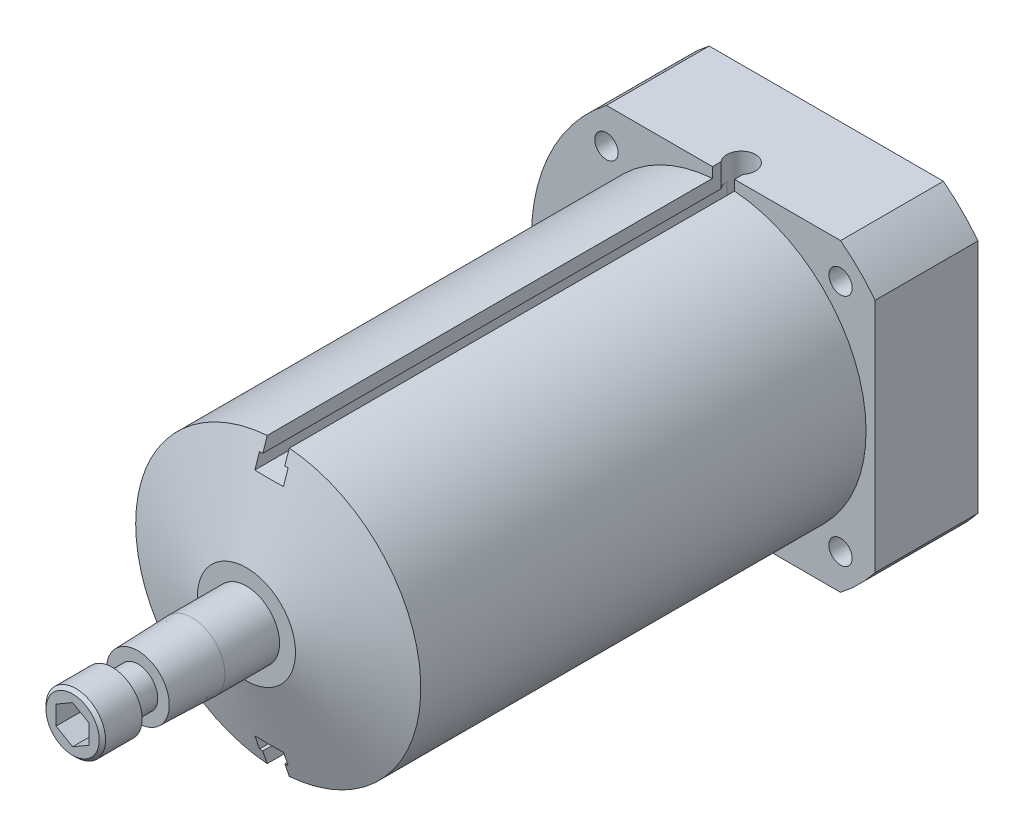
ISO-10303-21;
HEADER;
FILE_DESCRIPTION(('STEP AP214'),'2;1');
FILE_NAME('part.step','',(''),(''),'','','');
FILE_SCHEMA(('AUTOMOTIVE_DESIGN { 1 0 10303 214 1 1 1 1 }'));
ENDSEC;
DATA;
#1=APPLICATION_CONTEXT('core data for automotive mechanical design processes');
#2=APPLICATION_PROTOCOL_DEFINITION('international standard','automotive_design',2000,#1);
#3=PRODUCT_CONTEXT('',#1,'mechanical');
#4=PRODUCT('Part','Part','',(#3));
#5=PRODUCT_RELATED_PRODUCT_CATEGORY('part','',(#4));
#6=PRODUCT_DEFINITION_FORMATION('','',#4);
#7=PRODUCT_DEFINITION_CONTEXT('part definition',#1,'design');
#8=PRODUCT_DEFINITION('design','',#6,#7);
#9=PRODUCT_DEFINITION_SHAPE('','',#8);
#10=(LENGTH_UNIT() NAMED_UNIT(*) SI_UNIT(.MILLI.,.METRE.));
#11=(NAMED_UNIT(*) PLANE_ANGLE_UNIT() SI_UNIT($,.RADIAN.));
#12=(NAMED_UNIT(*) SI_UNIT($,.STERADIAN.) SOLID_ANGLE_UNIT());
#13=UNCERTAINTY_MEASURE_WITH_UNIT(LENGTH_MEASURE(1.E-05),#10,'distance_accuracy_value','');
#14=(GEOMETRIC_REPRESENTATION_CONTEXT(3) GLOBAL_UNCERTAINTY_ASSIGNED_CONTEXT((#13)) GLOBAL_UNIT_ASSIGNED_CONTEXT((#10,
#11,#12)) REPRESENTATION_CONTEXT('',''));
#15=CARTESIAN_POINT('',(0.,0.,0.));
#16=DIRECTION('',(0.,0.,1.));
#17=DIRECTION('',(1.,0.,0.));
#18=AXIS2_PLACEMENT_3D('',#15,#16,#17);
#19=CARTESIAN_POINT('',(0.,0.,138.938));
#20=DIRECTION('',(0.,0.,-1.));
#21=DIRECTION('',(-1.,0.,0.));
#22=AXIS2_PLACEMENT_3D('',#19,#20,#21);
#23=CYLINDRICAL_SURFACE('',#22,46.0375);
#24=CARTESIAN_POINT('',(-39.7925345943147,23.1517946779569,15.7988));
#25=CARTESIAN_POINT('',(-39.7925411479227,23.1517865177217,15.565330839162));
#26=CARTESIAN_POINT('',(-39.8024912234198,23.1347077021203,15.3317045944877));
#27=CARTESIAN_POINT('',(-39.8419011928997,23.0667682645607,14.8709216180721));
#28=CARTESIAN_POINT('',(-39.8713829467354,23.015869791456,14.6437724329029));
#29=CARTESIAN_POINT('',(-39.948593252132,22.8815922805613,14.2026836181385));
#30=CARTESIAN_POINT('',(-39.9963111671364,22.7982321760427,13.9887363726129));
#31=CARTESIAN_POINT('',(-40.1080081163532,22.6011473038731,13.5799935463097));
#32=CARTESIAN_POINT('',(-40.1719837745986,22.4874288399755,13.3851940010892));
#33=CARTESIAN_POINT('',(-40.3138303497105,22.2321345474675,13.0196424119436));
#34=CARTESIAN_POINT('',(-40.3917378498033,22.0904852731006,12.848955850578));
#35=CARTESIAN_POINT('',(-40.55832461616,21.783117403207,12.5370385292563));
#36=CARTESIAN_POINT('',(-40.647004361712,21.6173977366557,12.3958090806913));
#37=CARTESIAN_POINT('',(-40.832014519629,21.2658753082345,12.1465931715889));
#38=CARTESIAN_POINT('',(-40.9283577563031,21.0800386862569,12.0386639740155));
#39=CARTESIAN_POINT('',(-41.1251624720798,20.6934630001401,11.8594785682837));
#40=CARTESIAN_POINT('',(-41.2256238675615,20.4927242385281,11.7882216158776));
#41=CARTESIAN_POINT('',(-41.4270476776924,20.0824099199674,11.6845935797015));
#42=CARTESIAN_POINT('',(-41.5280079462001,19.8728602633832,11.6521157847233));
#43=CARTESIAN_POINT('',(-41.7275985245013,19.4502832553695,11.6266379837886));
#44=CARTESIAN_POINT('',(-41.8262288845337,19.2372559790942,11.6336371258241));
#45=CARTESIAN_POINT('',(-42.0181095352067,18.814452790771,11.6868275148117));
#46=CARTESIAN_POINT('',(-42.1113747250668,18.604669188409,11.7329040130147));
#47=CARTESIAN_POINT('',(-42.2905120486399,18.1937972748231,11.8627626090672));
#48=CARTESIAN_POINT('',(-42.3763841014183,17.9927090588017,11.9465451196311));
#49=CARTESIAN_POINT('',(-42.5389807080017,17.6048532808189,12.1495645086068));
#50=CARTESIAN_POINT('',(-42.6156918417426,17.4181068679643,12.26885252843));
#51=CARTESIAN_POINT('',(-42.7583893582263,17.0648147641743,12.5394596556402));
#52=CARTESIAN_POINT('',(-42.8243754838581,16.8982695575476,12.6907795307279));
#53=CARTESIAN_POINT('',(-42.9447979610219,16.58985538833,13.0218011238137));
#54=CARTESIAN_POINT('',(-42.9991920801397,16.4480769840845,13.2016025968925));
#55=CARTESIAN_POINT('',(-43.09540601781,16.1943157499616,13.5841365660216));
#56=CARTESIAN_POINT('',(-43.1372258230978,16.0823329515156,13.7868690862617));
#57=CARTESIAN_POINT('',(-43.2078263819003,15.8916812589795,14.2095831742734));
#58=CARTESIAN_POINT('',(-43.2366050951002,15.8130175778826,14.429567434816));
#59=CARTESIAN_POINT('',(-43.2808315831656,15.6915658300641,14.880505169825));
#60=CARTESIAN_POINT('',(-43.2962796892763,15.6487768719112,15.1114583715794));
#61=CARTESIAN_POINT('',(-43.3136781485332,15.6005563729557,15.576902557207));
#62=CARTESIAN_POINT('',(-43.3156761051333,15.5949930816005,15.8113781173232));
#63=CARTESIAN_POINT('',(-43.3062837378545,15.6210556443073,16.2779800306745));
#64=CARTESIAN_POINT('',(-43.2948935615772,15.6526810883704,16.5101064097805));
#65=CARTESIAN_POINT('',(-43.2588547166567,15.7520046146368,16.9650176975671));
#66=CARTESIAN_POINT('',(-43.234228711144,15.8196410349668,17.1878178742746));
#67=CARTESIAN_POINT('',(-43.1719626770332,15.9887810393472,17.6182258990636));
#68=CARTESIAN_POINT('',(-43.1343224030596,16.0902852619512,17.8258334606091));
#69=CARTESIAN_POINT('',(-43.0463042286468,16.3242981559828,18.2206004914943));
#70=CARTESIAN_POINT('',(-42.9958910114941,16.456892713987,18.4077011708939));
#71=CARTESIAN_POINT('',(-42.8830110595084,16.7488267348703,18.755548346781));
#72=CARTESIAN_POINT('',(-42.8205440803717,16.908166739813,18.9162943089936));
#73=CARTESIAN_POINT('',(-42.684289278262,17.2492496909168,19.2073473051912));
#74=CARTESIAN_POINT('',(-42.6104687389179,17.4310570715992,19.3375635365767));
#75=CARTESIAN_POINT('',(-42.4529634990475,17.811220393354,19.5632369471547));
#76=CARTESIAN_POINT('',(-42.3692789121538,18.0095761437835,19.6586945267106));
#77=CARTESIAN_POINT('',(-42.19393717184,18.4166247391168,19.8119858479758));
#78=CARTESIAN_POINT('',(-42.1022920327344,18.6253018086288,19.8698752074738));
#79=CARTESIAN_POINT('',(-41.9131425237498,19.047133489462,19.9465684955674));
#80=CARTESIAN_POINT('',(-41.8156382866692,19.2602879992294,19.9653733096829));
#81=CARTESIAN_POINT('',(-41.6177851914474,19.6841528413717,19.9633525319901));
#82=CARTESIAN_POINT('',(-41.5174477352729,19.8948691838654,19.9426682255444));
#83=CARTESIAN_POINT('',(-41.3165903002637,20.3087098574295,19.862551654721));
#84=CARTESIAN_POINT('',(-41.2160703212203,20.5118341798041,19.8031193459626));
#85=CARTESIAN_POINT('',(-41.0180982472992,20.9049153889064,19.6472311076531));
#86=CARTESIAN_POINT('',(-40.9206458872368,21.0948734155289,19.5507783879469));
#87=CARTESIAN_POINT('',(-40.7321449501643,21.4565939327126,19.3236028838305));
#88=CARTESIAN_POINT('',(-40.6410962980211,21.6283566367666,19.1928805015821));
#89=CARTESIAN_POINT('',(-40.4683967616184,21.9498002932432,18.9003458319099));
#90=CARTESIAN_POINT('',(-40.3867791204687,22.0994036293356,18.7384286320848));
#91=CARTESIAN_POINT('',(-40.2363977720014,22.3720363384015,18.3882988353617));
#92=CARTESIAN_POINT('',(-40.1676371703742,22.4950592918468,18.2000799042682));
#93=CARTESIAN_POINT('',(-40.0455982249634,22.7116049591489,17.8022605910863));
#94=CARTESIAN_POINT('',(-39.9923533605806,22.805063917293,17.59261527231));
#95=CARTESIAN_POINT('',(-39.9037962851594,22.9596702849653,17.1583595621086));
#96=CARTESIAN_POINT('',(-39.8684636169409,23.0208545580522,16.9337665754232));
#97=CARTESIAN_POINT('',(-39.8261451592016,23.093951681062,16.5563581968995));
#98=CARTESIAN_POINT('',(-39.8135649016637,23.115616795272,16.4059644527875));
#99=CARTESIAN_POINT('',(-39.7967574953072,23.1445409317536,16.1033360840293));
#100=CARTESIAN_POINT('',(-39.7925303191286,23.1518000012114,15.9511014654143));
#101=CARTESIAN_POINT('',(-39.7925345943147,23.1517946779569,15.7988));
#102=B_SPLINE_CURVE_WITH_KNOTS('',3,(#24,#25,#26,#27,#28,#29,#30,#31,#32,#33,#34,#35,#36,#37,
#38,#39,#40,#41,#42,#43,#44,#45,#46,#47,#48,#49,#50,#51,#52,#53,#54,#55,#56,#57,#58,#59,#60,#61,
#62,#63,#64,#65,#66,#67,#68,#69,#70,#71,#72,#73,#74,#75,#76,#77,#78,#79,#80,#81,#82,#83,#84,#85,
#86,#87,#88,#89,#90,#91,#92,#93,#94,#95,#96,#97,#98,#99,#100,#101),.UNSPECIFIED.,.T.,.F.,(4,2,2,
2,2,2,2,2,2,2,2,2,2,2,2,2,2,2,2,2,2,2,2,2,2,2,2,2,2,2,2,2,2,2,2,2,2,2,4),(0.,0.699851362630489,
1.40048732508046,2.10071525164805,2.80079789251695,3.50274660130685,4.20472655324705,
4.90790698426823,5.61107314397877,6.31229986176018,7.01351144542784,7.712671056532,
8.41183832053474,9.11201756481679,9.8122135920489,10.5149185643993,11.2176242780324,
11.9204398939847,12.6232380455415,13.3235475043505,14.0238492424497,14.7229556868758,
15.4220753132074,16.1231494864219,16.8242378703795,17.5273857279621,18.2305254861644,
18.932621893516,19.6347023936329,20.3342756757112,21.0338497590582,21.7333631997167,
22.4328684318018,23.1347686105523,23.8368381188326,24.5404115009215,25.2431795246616,
25.6997226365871,26.1562642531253),.UNSPECIFIED.);
#103=CARTESIAN_POINT('',(-39.7925345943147,23.1517946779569,15.7988));
#104=VERTEX_POINT('',#103);
#105=EDGE_CURVE('E517',#104,#104,#102,.T.);
#106=ORIENTED_EDGE('',*,*,#105,.F.);
#107=EDGE_LOOP('',(#106));
#108=FACE_BOUND('',#107,.T.);
#109=DIRECTION('',(0.,0.,-1.));
#110=VECTOR('',#109,1.);
#111=CARTESIAN_POINT('',(-28.0573699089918,-36.4998,138.938));
#112=LINE('',#111,#110);
#113=CARTESIAN_POINT('',(-28.0573699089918,-36.4998,24.638));
#114=VERTEX_POINT('',#113);
#115=CARTESIAN_POINT('',(-28.0573699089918,-36.4998,0.));
#116=VERTEX_POINT('',#115);
#117=EDGE_CURVE('E584',#114,#116,#112,.T.);
#118=ORIENTED_EDGE('',*,*,#117,.F.);
#119=CARTESIAN_POINT('',(0.,0.,24.638));
#120=DIRECTION('',(0.,0.,-1.));
#121=DIRECTION('',(-1.,0.,0.));
#122=AXIS2_PLACEMENT_3D('',#119,#120,#121);
#123=CIRCLE('',#122,46.0375);
#124=CARTESIAN_POINT('',(-28.0573699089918,36.4998,24.638));
#125=VERTEX_POINT('',#124);
#126=EDGE_CURVE('E587',#114,#125,#123,.T.);
#127=ORIENTED_EDGE('',*,*,#126,.T.);
#128=DIRECTION('',(0.,0.,-1.));
#129=VECTOR('',#128,1.);
#130=CARTESIAN_POINT('',(-28.0573699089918,36.4998,138.938));
#131=LINE('',#130,#129);
#132=CARTESIAN_POINT('',(-28.0573699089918,36.4998,0.));
#133=VERTEX_POINT('',#132);
#134=EDGE_CURVE('E753',#125,#133,#131,.T.);
#135=ORIENTED_EDGE('',*,*,#134,.T.);
#136=CARTESIAN_POINT('',(0.,0.,0.));
#137=DIRECTION('',(0.,0.,1.));
#138=DIRECTION('',(1.,0.,0.));
#139=AXIS2_PLACEMENT_3D('',#136,#137,#138);
#140=CIRCLE('',#139,46.0375);
#141=EDGE_CURVE('E590',#133,#116,#140,.T.);
#142=ORIENTED_EDGE('',*,*,#141,.T.);
#143=EDGE_LOOP('',(#118,#127,#135,#142));
#144=FACE_BOUND('',#143,.T.);
#145=CARTESIAN_POINT('',(-39.7925345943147,-23.1517946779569,15.7988));
#146=CARTESIAN_POINT('',(-39.7925411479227,-23.1517865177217,16.032269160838));
#147=CARTESIAN_POINT('',(-39.8024912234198,-23.1347077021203,16.2658954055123));
#148=CARTESIAN_POINT('',(-39.8419011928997,-23.0667682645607,16.726678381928));
#149=CARTESIAN_POINT('',(-39.8713829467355,-23.015869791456,16.9538275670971));
#150=CARTESIAN_POINT('',(-39.948593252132,-22.8815922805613,17.3949163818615));
#151=CARTESIAN_POINT('',(-39.9963111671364,-22.7982321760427,17.6088636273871));
#152=CARTESIAN_POINT('',(-40.1080081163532,-22.6011473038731,18.0176064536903));
#153=CARTESIAN_POINT('',(-40.1719837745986,-22.4874288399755,18.2124059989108));
#154=CARTESIAN_POINT('',(-40.3138303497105,-22.2321345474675,18.5779575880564));
#155=CARTESIAN_POINT('',(-40.3917378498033,-22.0904852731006,18.748644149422));
#156=CARTESIAN_POINT('',(-40.55832461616,-21.783117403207,19.0605614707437));
#157=CARTESIAN_POINT('',(-40.647004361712,-21.6173977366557,19.2017909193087));
#158=CARTESIAN_POINT('',(-40.832014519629,-21.2658753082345,19.4510068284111));
#159=CARTESIAN_POINT('',(-40.9283577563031,-21.0800386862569,19.5589360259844));
#160=CARTESIAN_POINT('',(-41.1251624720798,-20.6934630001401,19.7381214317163));
#161=CARTESIAN_POINT('',(-41.2256238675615,-20.4927242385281,19.8093783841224));
#162=CARTESIAN_POINT('',(-41.4270476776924,-20.0824099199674,19.9130064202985));
#163=CARTESIAN_POINT('',(-41.5280079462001,-19.8728602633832,19.9454842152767));
#164=CARTESIAN_POINT('',(-41.7275985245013,-19.4502832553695,19.9709620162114));
#165=CARTESIAN_POINT('',(-41.8262288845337,-19.2372559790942,19.9639628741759));
#166=CARTESIAN_POINT('',(-42.0181095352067,-18.814452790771,19.9107724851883));
#167=CARTESIAN_POINT('',(-42.1113747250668,-18.604669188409,19.8646959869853));
#168=CARTESIAN_POINT('',(-42.2905120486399,-18.1937972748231,19.7348373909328));
#169=CARTESIAN_POINT('',(-42.3763841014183,-17.9927090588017,19.6510548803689));
#170=CARTESIAN_POINT('',(-42.5389807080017,-17.6048532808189,19.4480354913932));
#171=CARTESIAN_POINT('',(-42.6156918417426,-17.4181068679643,19.32874747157));
#172=CARTESIAN_POINT('',(-42.7583893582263,-17.0648147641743,19.0581403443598));
#173=CARTESIAN_POINT('',(-42.8243754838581,-16.8982695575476,18.9068204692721));
#174=CARTESIAN_POINT('',(-42.9447979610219,-16.58985538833,18.5757988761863));
#175=CARTESIAN_POINT('',(-42.9991920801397,-16.4480769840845,18.3959974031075));
#176=CARTESIAN_POINT('',(-43.09540601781,-16.1943157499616,18.0134634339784));
#177=CARTESIAN_POINT('',(-43.1372258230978,-16.0823329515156,17.8107309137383));
#178=CARTESIAN_POINT('',(-43.2078263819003,-15.8916812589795,17.3880168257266));
#179=CARTESIAN_POINT('',(-43.2366050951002,-15.8130175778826,17.1680325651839));
#180=CARTESIAN_POINT('',(-43.2808315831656,-15.6915658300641,16.717094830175));
#181=CARTESIAN_POINT('',(-43.2962796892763,-15.6487768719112,16.4861416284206));
#182=CARTESIAN_POINT('',(-43.3136781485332,-15.6005563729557,16.020697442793));
#183=CARTESIAN_POINT('',(-43.3156761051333,-15.5949930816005,15.7862218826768));
#184=CARTESIAN_POINT('',(-43.3062837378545,-15.6210556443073,15.3196199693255));
#185=CARTESIAN_POINT('',(-43.2948935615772,-15.6526810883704,15.0874935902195));
#186=CARTESIAN_POINT('',(-43.2588547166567,-15.7520046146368,14.6325823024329));
#187=CARTESIAN_POINT('',(-43.234228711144,-15.8196410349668,14.4097821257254));
#188=CARTESIAN_POINT('',(-43.1719626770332,-15.9887810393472,13.9793741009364));
#189=CARTESIAN_POINT('',(-43.1343224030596,-16.0902852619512,13.7717665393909));
#190=CARTESIAN_POINT('',(-43.0463042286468,-16.3242981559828,13.3769995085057));
#191=CARTESIAN_POINT('',(-42.9958910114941,-16.456892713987,13.1898988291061));
#192=CARTESIAN_POINT('',(-42.8830110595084,-16.7488267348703,12.8420516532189));
#193=CARTESIAN_POINT('',(-42.8205440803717,-16.908166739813,12.6813056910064));
#194=CARTESIAN_POINT('',(-42.684289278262,-17.2492496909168,12.3902526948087));
#195=CARTESIAN_POINT('',(-42.6104687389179,-17.4310570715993,12.2600364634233));
#196=CARTESIAN_POINT('',(-42.4529634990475,-17.811220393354,12.0343630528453));
#197=CARTESIAN_POINT('',(-42.3692789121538,-18.0095761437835,11.9389054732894));
#198=CARTESIAN_POINT('',(-42.19393717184,-18.4166247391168,11.7856141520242));
#199=CARTESIAN_POINT('',(-42.1022920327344,-18.6253018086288,11.7277247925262));
#200=CARTESIAN_POINT('',(-41.9131425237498,-19.047133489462,11.6510315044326));
#201=CARTESIAN_POINT('',(-41.8156382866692,-19.2602879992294,11.6322266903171));
#202=CARTESIAN_POINT('',(-41.6177851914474,-19.6841528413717,11.6342474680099));
#203=CARTESIAN_POINT('',(-41.5174477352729,-19.8948691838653,11.6549317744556));
#204=CARTESIAN_POINT('',(-41.3165903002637,-20.3087098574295,11.735048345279));
#205=CARTESIAN_POINT('',(-41.2160703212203,-20.5118341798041,11.7944806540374));
#206=CARTESIAN_POINT('',(-41.0180982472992,-20.9049153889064,11.9503688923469));
#207=CARTESIAN_POINT('',(-40.9206458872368,-21.0948734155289,12.0468216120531));
#208=CARTESIAN_POINT('',(-40.7321449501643,-21.4565939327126,12.2739971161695));
#209=CARTESIAN_POINT('',(-40.6410962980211,-21.6283566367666,12.4047194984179));
#210=CARTESIAN_POINT('',(-40.4683967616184,-21.9498002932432,12.6972541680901));
#211=CARTESIAN_POINT('',(-40.3867791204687,-22.0994036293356,12.8591713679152));
#212=CARTESIAN_POINT('',(-40.2363977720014,-22.3720363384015,13.2093011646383));
#213=CARTESIAN_POINT('',(-40.1676371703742,-22.4950592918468,13.3975200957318));
#214=CARTESIAN_POINT('',(-40.0455982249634,-22.7116049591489,13.7953394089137));
#215=CARTESIAN_POINT('',(-39.9923533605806,-22.805063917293,14.00498472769));
#216=CARTESIAN_POINT('',(-39.9037962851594,-22.9596702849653,14.4392404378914));
#217=CARTESIAN_POINT('',(-39.8684636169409,-23.0208545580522,14.6638334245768));
#218=CARTESIAN_POINT('',(-39.8261451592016,-23.093951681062,15.0412418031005));
#219=CARTESIAN_POINT('',(-39.8135649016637,-23.115616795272,15.1916355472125));
#220=CARTESIAN_POINT('',(-39.7967574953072,-23.1445409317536,15.4942639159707));
#221=CARTESIAN_POINT('',(-39.7925303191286,-23.1518000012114,15.6464985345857));
#222=CARTESIAN_POINT('',(-39.7925345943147,-23.1517946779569,15.7988));
#223=B_SPLINE_CURVE_WITH_KNOTS('',3,(#145,#146,#147,#148,#149,#150,#151,#152,#153,#154,#155,
#156,#157,#158,#159,#160,#161,#162,#163,#164,#165,#166,#167,#168,#169,#170,#171,#172,#173,#174,
#175,#176,#177,#178,#179,#180,#181,#182,#183,#184,#185,#186,#187,#188,#189,#190,#191,#192,#193,
#194,#195,#196,#197,#198,#199,#200,#201,#202,#203,#204,#205,#206,#207,#208,#209,#210,#211,#212,
#213,#214,#215,#216,#217,#218,#219,#220,#221,#222),.UNSPECIFIED.,.T.,.F.,(4,2,2,2,2,2,2,2,2,2,2,
2,2,2,2,2,2,2,2,2,2,2,2,2,2,2,2,2,2,2,2,2,2,2,2,2,2,2,4),(0.,0.699851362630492,1.40048732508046,
2.10071525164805,2.80079789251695,3.50274660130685,4.20472655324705,4.90790698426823,
5.61107314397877,6.31229986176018,7.01351144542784,7.712671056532,8.41183832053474,
9.11201756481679,9.8122135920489,10.5149185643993,11.2176242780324,11.9204398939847,
12.6232380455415,13.3235475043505,14.0238492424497,14.7229556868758,15.4220753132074,
16.1231494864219,16.8242378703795,17.5273857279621,18.2305254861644,18.932621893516,
19.6347023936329,20.3342756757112,21.0338497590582,21.7333631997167,22.4328684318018,
23.1347686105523,23.8368381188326,24.5404115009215,25.2431795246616,25.6997226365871,
26.1562642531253),.UNSPECIFIED.);
#224=CARTESIAN_POINT('',(-39.7925345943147,-23.1517946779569,15.7988));
#225=VERTEX_POINT('',#224);
#226=EDGE_CURVE('E510',#225,#225,#223,.T.);
#227=ORIENTED_EDGE('',*,*,#226,.F.);
#228=EDGE_LOOP('',(#227));
#229=FACE_BOUND('',#228,.T.);
#230=ADVANCED_FACE('F36',(#108,#144,#229),#23,.T.);
#231=CARTESIAN_POINT('',(-46.0375,0.,24.638));
#232=DIRECTION('',(0.,0.,-1.));
#233=DIRECTION('',(-1.,0.,0.));
#234=AXIS2_PLACEMENT_3D('',#231,#232,#233);
#235=PLANE('',#234);
#236=CARTESIAN_POINT('',(-28.0453398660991,-28.0453398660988,24.638));
#237=DIRECTION('',(0.,0.,1.));
#238=DIRECTION('',(1.,0.,0.));
#239=AXIS2_PLACEMENT_3D('',#236,#237,#238);
#240=CIRCLE('',#239,2.79400000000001);
#241=CARTESIAN_POINT('',(-25.2513398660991,-28.0453398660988,24.638));
#242=VERTEX_POINT('',#241);
#243=EDGE_CURVE('E694',#242,#242,#240,.T.);
#244=ORIENTED_EDGE('',*,*,#243,.F.);
#245=EDGE_LOOP('',(#244));
#246=FACE_BOUND('',#245,.T.);
#247=CARTESIAN_POINT('',(28.0453398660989,28.045339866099,24.638));
#248=DIRECTION('',(0.,0.,1.));
#249=DIRECTION('',(1.,0.,0.));
#250=AXIS2_PLACEMENT_3D('',#247,#248,#249);
#251=CIRCLE('',#250,2.79400000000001);
#252=CARTESIAN_POINT('',(30.8393398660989,28.045339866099,24.638));
#253=VERTEX_POINT('',#252);
#254=EDGE_CURVE('E706',#253,#253,#251,.T.);
#255=ORIENTED_EDGE('',*,*,#254,.F.);
#256=EDGE_LOOP('',(#255));
#257=FACE_BOUND('',#256,.T.);
#258=DIRECTION('',(1.,0.,0.));
#259=VECTOR('',#258,1.);
#260=CARTESIAN_POINT('',(-28.0573699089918,36.4998,24.638));
#261=LINE('',#260,#259);
#262=CARTESIAN_POINT('',(2.6416,36.4998,24.638));
#263=VERTEX_POINT('',#262);
#264=CARTESIAN_POINT('',(28.0573699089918,36.4998,24.638));
#265=VERTEX_POINT('',#264);
#266=EDGE_CURVE('E595',#263,#265,#261,.T.);
#267=ORIENTED_EDGE('',*,*,#266,.F.);
#268=DIRECTION('',(0.,-1.,0.));
#269=VECTOR('',#268,1.);
#270=CARTESIAN_POINT('',(2.64159999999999,0.,24.638));
#271=LINE('',#270,#269);
#272=CARTESIAN_POINT('',(2.6416,34.0607181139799,24.638));
#273=VERTEX_POINT('',#272);
#274=EDGE_CURVE('E680',#263,#273,#271,.T.);
#275=ORIENTED_EDGE('',*,*,#274,.T.);
#276=CARTESIAN_POINT('',(0.,0.,24.638));
#277=DIRECTION('',(0.,0.,-1.));
#278=DIRECTION('',(-1.,0.,0.));
#279=AXIS2_PLACEMENT_3D('',#276,#277,#278);
#280=CIRCLE('',#279,34.163);
#281=CARTESIAN_POINT('',(-2.6416,34.0607181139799,24.638));
#282=VERTEX_POINT('',#281);
#283=EDGE_CURVE('E727',#273,#282,#280,.T.);
#284=ORIENTED_EDGE('',*,*,#283,.T.);
#285=DIRECTION('',(0.,1.,0.));
#286=VECTOR('',#285,1.);
#287=CARTESIAN_POINT('',(-2.64159999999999,0.,24.638));
#288=LINE('',#287,#286);
#289=CARTESIAN_POINT('',(-2.6416,36.4998,24.638));
#290=VERTEX_POINT('',#289);
#291=EDGE_CURVE('E672',#282,#290,#288,.T.);
#292=ORIENTED_EDGE('',*,*,#291,.T.);
#293=EDGE_CURVE('E598',#125,#290,#261,.T.);
#294=ORIENTED_EDGE('',*,*,#293,.F.);
#295=ORIENTED_EDGE('',*,*,#126,.F.);
#296=DIRECTION('',(-1.,0.,0.));
#297=VECTOR('',#296,1.);
#298=CARTESIAN_POINT('',(-28.0573699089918,-36.4998,24.638));
#299=LINE('',#298,#297);
#300=CARTESIAN_POINT('',(28.0573699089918,-36.4998,24.638));
#301=VERTEX_POINT('',#300);
#302=EDGE_CURVE('E736',#301,#114,#299,.T.);
#303=ORIENTED_EDGE('',*,*,#302,.F.);
#304=CARTESIAN_POINT('',(36.3474,-28.2545203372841,24.638));
#305=VERTEX_POINT('',#304);
#306=EDGE_CURVE('E731',#305,#301,#123,.T.);
#307=ORIENTED_EDGE('',*,*,#306,.F.);
#308=DIRECTION('',(0.,-1.,0.));
#309=VECTOR('',#308,1.);
#310=CARTESIAN_POINT('',(36.3474,28.2545203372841,24.638));
#311=LINE('',#310,#309);
#312=CARTESIAN_POINT('',(36.3474,28.2545203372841,24.638));
#313=VERTEX_POINT('',#312);
#314=EDGE_CURVE('E733',#313,#305,#311,.T.);
#315=ORIENTED_EDGE('',*,*,#314,.F.);
#316=EDGE_CURVE('E732',#265,#313,#123,.T.);
#317=ORIENTED_EDGE('',*,*,#316,.F.);
#318=EDGE_LOOP('',(#267,#275,#284,#292,#294,#295,#303,#307,#315,#317));
#319=FACE_BOUND('',#318,.T.);
#320=CARTESIAN_POINT('',(28.0453398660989,-28.045339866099,24.638));
#321=DIRECTION('',(0.,0.,1.));
#322=DIRECTION('',(1.,0.,0.));
#323=AXIS2_PLACEMENT_3D('',#320,#321,#322);
#324=CIRCLE('',#323,2.79400000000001);
#325=CARTESIAN_POINT('',(30.8393398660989,-28.045339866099,24.638));
#326=VERTEX_POINT('',#325);
#327=EDGE_CURVE('E700',#326,#326,#324,.T.);
#328=ORIENTED_EDGE('',*,*,#327,.F.);
#329=EDGE_LOOP('',(#328));
#330=FACE_BOUND('',#329,.T.);
#331=CARTESIAN_POINT('',(-28.0453398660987,28.0453398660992,24.638));
#332=DIRECTION('',(0.,0.,1.));
#333=DIRECTION('',(1.,0.,0.));
#334=AXIS2_PLACEMENT_3D('',#331,#332,#333);
#335=CIRCLE('',#334,2.79400000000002);
#336=CARTESIAN_POINT('',(-25.2513398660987,28.0453398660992,24.638));
#337=VERTEX_POINT('',#336);
#338=EDGE_CURVE('E522',#337,#337,#335,.T.);
#339=ORIENTED_EDGE('',*,*,#338,.F.);
#340=EDGE_LOOP('',(#339));
#341=FACE_BOUND('',#340,.T.);
#342=ADVANCED_FACE('F571',(#246,#257,#319,#330,#341),#235,.F.);
#343=CARTESIAN_POINT('',(-28.0573699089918,-36.4998,138.938));
#344=DIRECTION('',(0.,1.,0.));
#345=DIRECTION('',(0.,0.,1.));
#346=AXIS2_PLACEMENT_3D('',#343,#344,#345);
#347=PLANE('',#346);
#348=DIRECTION('',(0.,0.,-1.));
#349=VECTOR('',#348,1.);
#350=CARTESIAN_POINT('',(28.0573699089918,-36.4998,138.938));
#351=LINE('',#350,#349);
#352=CARTESIAN_POINT('',(28.0573699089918,-36.4998,0.));
#353=VERTEX_POINT('',#352);
#354=EDGE_CURVE('E596',#301,#353,#351,.T.);
#355=ORIENTED_EDGE('',*,*,#354,.F.);
#356=ORIENTED_EDGE('',*,*,#302,.T.);
#357=ORIENTED_EDGE('',*,*,#117,.T.);
#358=DIRECTION('',(1.,0.,0.));
#359=VECTOR('',#358,1.);
#360=CARTESIAN_POINT('',(-28.0573699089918,-36.4998,0.));
#361=LINE('',#360,#359);
#362=EDGE_CURVE('E739',#116,#353,#361,.T.);
#363=ORIENTED_EDGE('',*,*,#362,.T.);
#364=EDGE_LOOP('',(#355,#356,#357,#363));
#365=FACE_BOUND('',#364,.T.);
#366=ADVANCED_FACE('F576',(#365),#347,.F.);
#367=CARTESIAN_POINT('',(0.,0.,138.938));
#368=DIRECTION('',(0.,0.,-1.));
#369=DIRECTION('',(-1.,0.,0.));
#370=AXIS2_PLACEMENT_3D('',#367,#368,#369);
#371=CYLINDRICAL_SURFACE('',#370,46.0375);
#372=DIRECTION('',(0.,0.,-1.));
#373=VECTOR('',#372,1.);
#374=CARTESIAN_POINT('',(36.3474,-28.2545203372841,138.938));
#375=LINE('',#374,#373);
#376=CARTESIAN_POINT('',(36.3474,-28.2545203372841,0.));
#377=VERTEX_POINT('',#376);
#378=EDGE_CURVE('E599',#305,#377,#375,.T.);
#379=ORIENTED_EDGE('',*,*,#378,.F.);
#380=ORIENTED_EDGE('',*,*,#306,.T.);
#381=ORIENTED_EDGE('',*,*,#354,.T.);
#382=CARTESIAN_POINT('',(0.,0.,0.));
#383=DIRECTION('',(0.,0.,1.));
#384=DIRECTION('',(1.,0.,0.));
#385=AXIS2_PLACEMENT_3D('',#382,#383,#384);
#386=CIRCLE('',#385,46.0375);
#387=EDGE_CURVE('E741',#353,#377,#386,.T.);
#388=ORIENTED_EDGE('',*,*,#387,.T.);
#389=EDGE_LOOP('',(#379,#380,#381,#388));
#390=FACE_BOUND('',#389,.T.);
#391=ADVANCED_FACE('F767',(#390),#371,.T.);
#392=CARTESIAN_POINT('',(36.3474,28.2545203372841,138.938));
#393=DIRECTION('',(-1.,0.,0.));
#394=DIRECTION('',(0.,0.,1.));
#395=AXIS2_PLACEMENT_3D('',#392,#393,#394);
#396=PLANE('',#395);
#397=DIRECTION('',(0.,0.,-1.));
#398=VECTOR('',#397,1.);
#399=CARTESIAN_POINT('',(36.3474,28.2545203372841,138.938));
#400=LINE('',#399,#398);
#401=CARTESIAN_POINT('',(36.3474,28.2545203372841,0.));
#402=VERTEX_POINT('',#401);
#403=EDGE_CURVE('E757',#313,#402,#400,.T.);
#404=ORIENTED_EDGE('',*,*,#403,.F.);
#405=ORIENTED_EDGE('',*,*,#314,.T.);
#406=ORIENTED_EDGE('',*,*,#378,.T.);
#407=DIRECTION('',(0.,1.,0.));
#408=VECTOR('',#407,1.);
#409=CARTESIAN_POINT('',(36.3474,28.2545203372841,0.));
#410=LINE('',#409,#408);
#411=EDGE_CURVE('E744',#377,#402,#410,.T.);
#412=ORIENTED_EDGE('',*,*,#411,.T.);
#413=EDGE_LOOP('',(#404,#405,#406,#412));
#414=FACE_BOUND('',#413,.T.);
#415=ADVANCED_FACE('F761',(#414),#396,.F.);
#416=CARTESIAN_POINT('',(0.,0.,138.938));
#417=DIRECTION('',(0.,0.,-1.));
#418=DIRECTION('',(-1.,0.,0.));
#419=AXIS2_PLACEMENT_3D('',#416,#417,#418);
#420=CYLINDRICAL_SURFACE('',#419,46.0375);
#421=DIRECTION('',(0.,0.,-1.));
#422=VECTOR('',#421,1.);
#423=CARTESIAN_POINT('',(28.0573699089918,36.4998,138.938));
#424=LINE('',#423,#422);
#425=CARTESIAN_POINT('',(28.0573699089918,36.4998,0.));
#426=VERTEX_POINT('',#425);
#427=EDGE_CURVE('E755',#265,#426,#424,.T.);
#428=ORIENTED_EDGE('',*,*,#427,.F.);
#429=ORIENTED_EDGE('',*,*,#316,.T.);
#430=ORIENTED_EDGE('',*,*,#403,.T.);
#431=CARTESIAN_POINT('',(0.,0.,0.));
#432=DIRECTION('',(0.,0.,1.));
#433=DIRECTION('',(1.,0.,0.));
#434=AXIS2_PLACEMENT_3D('',#431,#432,#433);
#435=CIRCLE('',#434,46.0375);
#436=EDGE_CURVE('E747',#402,#426,#435,.T.);
#437=ORIENTED_EDGE('',*,*,#436,.T.);
#438=EDGE_LOOP('',(#428,#429,#430,#437));
#439=FACE_BOUND('',#438,.T.);
#440=ADVANCED_FACE('F774',(#439),#420,.T.);
#441=CARTESIAN_POINT('',(-28.0573699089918,36.4998,138.938));
#442=DIRECTION('',(0.,-1.,0.));
#443=DIRECTION('',(0.,0.,-1.));
#444=AXIS2_PLACEMENT_3D('',#441,#442,#443);
#445=PLANE('',#444);
#446=DIRECTION('',(0.,0.,-1.));
#447=VECTOR('',#446,1.);
#448=CARTESIAN_POINT('',(-2.6416,36.4998,138.938));
#449=LINE('',#448,#447);
#450=CARTESIAN_POINT('',(-2.6416,36.4998,22.5825189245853));
#451=VERTEX_POINT('',#450);
#452=EDGE_CURVE('E675',#290,#451,#449,.T.);
#453=ORIENTED_EDGE('',*,*,#452,.T.);
#454=CARTESIAN_POINT('',(0.,36.4998,20.3962));
#455=DIRECTION('',(0.,1.,0.));
#456=DIRECTION('',(0.,0.,1.));
#457=AXIS2_PLACEMENT_3D('',#454,#455,#456);
#458=CIRCLE('',#457,3.429);
#459=CARTESIAN_POINT('',(2.6416,36.4998,22.5825189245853));
#460=VERTEX_POINT('',#459);
#461=EDGE_CURVE('E60',#460,#451,#458,.T.);
#462=ORIENTED_EDGE('',*,*,#461,.F.);
#463=DIRECTION('',(0.,0.,1.));
#464=VECTOR('',#463,1.);
#465=CARTESIAN_POINT('',(2.6416,36.4998,138.938));
#466=LINE('',#465,#464);
#467=EDGE_CURVE('E683',#460,#263,#466,.T.);
#468=ORIENTED_EDGE('',*,*,#467,.T.);
#469=ORIENTED_EDGE('',*,*,#266,.T.);
#470=ORIENTED_EDGE('',*,*,#427,.T.);
#471=DIRECTION('',(-1.,0.,0.));
#472=VECTOR('',#471,1.);
#473=CARTESIAN_POINT('',(-28.0573699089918,36.4998,0.));
#474=LINE('',#473,#472);
#475=EDGE_CURVE('E750',#426,#133,#474,.T.);
#476=ORIENTED_EDGE('',*,*,#475,.T.);
#477=ORIENTED_EDGE('',*,*,#134,.F.);
#478=ORIENTED_EDGE('',*,*,#293,.T.);
#479=EDGE_LOOP('',(#453,#462,#468,#469,#470,#476,#477,#478));
#480=FACE_BOUND('',#479,.T.);
#481=ADVANCED_FACE('F824',(#480),#445,.F.);
#482=CARTESIAN_POINT('',(0.,0.,0.));
#483=DIRECTION('',(0.,0.,1.));
#484=DIRECTION('',(1.,0.,0.));
#485=AXIS2_PLACEMENT_3D('',#482,#483,#484);
#486=PLANE('',#485);
#487=CARTESIAN_POINT('',(-28.0453398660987,28.0453398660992,0.));
#488=DIRECTION('',(0.,0.,1.));
#489=DIRECTION('',(1.,0.,0.));
#490=AXIS2_PLACEMENT_3D('',#487,#488,#489);
#491=CIRCLE('',#490,2.79400000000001);
#492=CARTESIAN_POINT('',(-25.2513398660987,28.0453398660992,0.));
#493=VERTEX_POINT('',#492);
#494=EDGE_CURVE('E691',#493,#493,#491,.T.);
#495=ORIENTED_EDGE('',*,*,#494,.T.);
#496=EDGE_LOOP('',(#495));
#497=FACE_BOUND('',#496,.T.);
#498=CARTESIAN_POINT('',(-28.0453398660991,-28.0453398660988,0.));
#499=DIRECTION('',(0.,0.,1.));
#500=DIRECTION('',(1.,0.,0.));
#501=AXIS2_PLACEMENT_3D('',#498,#499,#500);
#502=CIRCLE('',#501,2.79400000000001);
#503=CARTESIAN_POINT('',(-25.2513398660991,-28.0453398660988,0.));
#504=VERTEX_POINT('',#503);
#505=EDGE_CURVE('E697',#504,#504,#502,.T.);
#506=ORIENTED_EDGE('',*,*,#505,.T.);
#507=EDGE_LOOP('',(#506));
#508=FACE_BOUND('',#507,.T.);
#509=CARTESIAN_POINT('',(28.0453398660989,-28.045339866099,0.));
#510=DIRECTION('',(0.,0.,1.));
#511=DIRECTION('',(1.,0.,0.));
#512=AXIS2_PLACEMENT_3D('',#509,#510,#511);
#513=CIRCLE('',#512,2.79400000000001);
#514=CARTESIAN_POINT('',(30.8393398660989,-28.045339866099,0.));
#515=VERTEX_POINT('',#514);
#516=EDGE_CURVE('E703',#515,#515,#513,.T.);
#517=ORIENTED_EDGE('',*,*,#516,.T.);
#518=EDGE_LOOP('',(#517));
#519=FACE_BOUND('',#518,.T.);
#520=CARTESIAN_POINT('',(28.0453398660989,28.045339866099,0.));
#521=DIRECTION('',(0.,0.,1.));
#522=DIRECTION('',(1.,0.,0.));
#523=AXIS2_PLACEMENT_3D('',#520,#521,#522);
#524=CIRCLE('',#523,2.79400000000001);
#525=CARTESIAN_POINT('',(30.8393398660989,28.045339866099,0.));
#526=VERTEX_POINT('',#525);
#527=EDGE_CURVE('E709',#526,#526,#524,.T.);
#528=ORIENTED_EDGE('',*,*,#527,.T.);
#529=EDGE_LOOP('',(#528));
#530=FACE_BOUND('',#529,.T.);
#531=ORIENTED_EDGE('',*,*,#141,.F.);
#532=ORIENTED_EDGE('',*,*,#475,.F.);
#533=ORIENTED_EDGE('',*,*,#436,.F.);
#534=ORIENTED_EDGE('',*,*,#411,.F.);
#535=ORIENTED_EDGE('',*,*,#387,.F.);
#536=ORIENTED_EDGE('',*,*,#362,.F.);
#537=EDGE_LOOP('',(#531,#532,#533,#534,#535,#536));
#538=FACE_BOUND('',#537,.T.);
#539=ADVANCED_FACE('F770',(#497,#508,#519,#530,#538),#486,.F.);
#540=CARTESIAN_POINT('',(0.,0.,0.));
#541=DIRECTION('',(0.,0.,-1.));
#542=DIRECTION('',(-1.,0.,0.));
#543=AXIS2_PLACEMENT_3D('',#540,#541,#542);
#544=CYLINDRICAL_SURFACE('',#543,34.163);
#545=DIRECTION('',(0.,0.,-1.));
#546=VECTOR('',#545,1.);
#547=CARTESIAN_POINT('',(2.64160000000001,-34.0607181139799,0.));
#548=LINE('',#547,#546);
#549=CARTESIAN_POINT('',(2.64160000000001,-34.0607181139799,131.318));
#550=VERTEX_POINT('',#549);
#551=CARTESIAN_POINT('',(2.64160000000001,-34.0607181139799,42.6993189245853));
#552=VERTEX_POINT('',#551);
#553=EDGE_CURVE('E645',#550,#552,#548,.T.);
#554=ORIENTED_EDGE('',*,*,#553,.T.);
#555=CARTESIAN_POINT('',(0.,-34.163,37.084));
#556=CARTESIAN_POINT('',(-0.192089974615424,-34.162997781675,37.0840083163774));
#557=CARTESIAN_POINT('',(-0.384306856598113,-34.1613626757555,37.1001954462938));
#558=CARTESIAN_POINT('',(-0.763411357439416,-34.1549971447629,37.1645245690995));
#559=CARTESIAN_POINT('',(-0.950292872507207,-34.1502633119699,37.2127017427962));
#560=CARTESIAN_POINT('',(-1.31318196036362,-34.1382346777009,37.3395940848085));
#561=CARTESIAN_POINT('',(-1.48919603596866,-34.1309414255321,37.4182907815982));
#562=CARTESIAN_POINT('',(-1.82547852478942,-34.1146094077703,37.6039523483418));
#563=CARTESIAN_POINT('',(-1.98575005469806,-34.1055709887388,37.7109116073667));
#564=CARTESIAN_POINT('',(-2.28661709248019,-34.0867244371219,37.9504781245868));
#565=CARTESIAN_POINT('',(-2.42714754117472,-34.0769139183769,38.0831669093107));
#566=CARTESIAN_POINT('',(-2.68398409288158,-34.0576485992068,38.3702520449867));
#567=CARTESIAN_POINT('',(-2.80028907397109,-34.0481938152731,38.5246494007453));
#568=CARTESIAN_POINT('',(-3.00560370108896,-34.0306860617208,38.8511761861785));
#569=CARTESIAN_POINT('',(-3.09455446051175,-34.022636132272,39.0233428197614));
#570=CARTESIAN_POINT('',(-3.24225964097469,-34.0088790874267,39.3802630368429));
#571=CARTESIAN_POINT('',(-3.30101481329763,-34.0031719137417,39.5650163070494));
#572=CARTESIAN_POINT('',(-3.38646807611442,-33.994768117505,39.9412017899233));
#573=CARTESIAN_POINT('',(-3.41327407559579,-33.9920613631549,40.1326092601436));
#574=CARTESIAN_POINT('',(-3.43440163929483,-33.9899334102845,40.5172241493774));
#575=CARTESIAN_POINT('',(-3.42872406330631,-33.9905121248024,40.7104315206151));
#576=CARTESIAN_POINT('',(-3.38513458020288,-33.9948804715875,41.0924178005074));
#577=CARTESIAN_POINT('',(-3.34734050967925,-33.9986583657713,41.2812103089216));
#578=CARTESIAN_POINT('',(-3.24077422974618,-34.008981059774,41.6497590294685));
#579=CARTESIAN_POINT('',(-3.17200159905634,-34.0155258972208,41.8295151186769));
#580=CARTESIAN_POINT('',(-3.00530037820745,-34.0306585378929,42.1752605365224));
#581=CARTESIAN_POINT('',(-2.90731952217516,-34.039249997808,42.3412244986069));
#582=CARTESIAN_POINT('',(-2.68502072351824,-34.0575047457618,42.6543969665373));
#583=CARTESIAN_POINT('',(-2.56070200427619,-34.0671680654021,42.8016049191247));
#584=CARTESIAN_POINT('',(-2.28859835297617,-34.0865300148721,43.0737714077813));
#585=CARTESIAN_POINT('',(-2.14071165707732,-34.0962286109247,43.1986282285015));
#586=CARTESIAN_POINT('',(-1.82602333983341,-34.1145277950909,43.4217598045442));
#587=CARTESIAN_POINT('',(-1.65922169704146,-34.1231283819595,43.5200345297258));
#588=CARTESIAN_POINT('',(-1.31136779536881,-34.1382653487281,43.6872082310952));
#589=CARTESIAN_POINT('',(-1.13031303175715,-34.1448013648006,43.7561020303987));
#590=CARTESIAN_POINT('',(-0.759125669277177,-34.1550690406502,43.8624836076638));
#591=CARTESIAN_POINT('',(-0.568993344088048,-34.1588007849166,43.8999723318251));
#592=CARTESIAN_POINT('',(-0.185928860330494,-34.163028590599,43.9423505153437));
#593=CARTESIAN_POINT('',(0.00698762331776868,-34.1635385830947,43.9473803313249));
#594=CARTESIAN_POINT('',(0.390917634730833,-34.1613027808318,43.9250665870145));
#595=CARTESIAN_POINT('',(0.58193118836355,-34.1585570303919,43.8977234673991));
#596=CARTESIAN_POINT('',(0.956227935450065,-34.1501272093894,43.8115564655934));
#597=CARTESIAN_POINT('',(1.13952641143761,-34.1444492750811,43.7527983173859));
#598=CARTESIAN_POINT('',(1.4936649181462,-34.1307920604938,43.6055367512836));
#599=CARTESIAN_POINT('',(1.66450466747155,-34.122812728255,43.517032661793));
#600=CARTESIAN_POINT('',(1.98951069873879,-34.1054105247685,43.3124435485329));
#601=CARTESIAN_POINT('',(2.14361868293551,-34.095982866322,43.196266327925));
#602=CARTESIAN_POINT('',(2.43019646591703,-34.0767572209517,42.9397609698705));
#603=CARTESIAN_POINT('',(2.5626657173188,-34.0669592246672,42.7994322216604));
#604=CARTESIAN_POINT('',(2.80269319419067,-34.0480552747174,42.4979947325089));
#605=CARTESIAN_POINT('',(2.91015929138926,-34.0389519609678,42.336812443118));
#606=CARTESIAN_POINT('',(3.09649651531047,-34.0225082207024,41.9986059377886));
#607=CARTESIAN_POINT('',(3.17536803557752,-34.0151677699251,41.8215819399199));
#608=CARTESIAN_POINT('',(3.30212307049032,-34.0030973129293,41.4570327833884));
#609=CARTESIAN_POINT('',(3.35006136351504,-33.9983626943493,41.2695268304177));
#610=CARTESIAN_POINT('',(3.41376686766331,-33.9920256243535,40.8890770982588));
#611=CARTESIAN_POINT('',(3.42953500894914,-33.9904230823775,40.696133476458));
#612=CARTESIAN_POINT('',(3.42843964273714,-33.9905335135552,40.3112010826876));
#613=CARTESIAN_POINT('',(3.41172085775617,-33.9922317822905,40.1192118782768));
#614=CARTESIAN_POINT('',(3.34642970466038,-33.9987211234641,39.7407842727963));
#615=CARTESIAN_POINT('',(3.29785730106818,-34.003512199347,39.554345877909));
#616=CARTESIAN_POINT('',(3.1702776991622,-34.015643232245,39.1923135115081));
#617=CARTESIAN_POINT('',(3.09127478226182,-34.022982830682,39.0167180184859));
#618=CARTESIAN_POINT('',(2.90509168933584,-34.0393846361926,38.6812565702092));
#619=CARTESIAN_POINT('',(2.79791166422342,-34.0484468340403,38.521390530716));
#620=CARTESIAN_POINT('',(2.55787342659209,-34.067321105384,38.2211843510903));
#621=CARTESIAN_POINT('',(2.42490737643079,-34.0771362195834,38.0809306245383));
#622=CARTESIAN_POINT('',(2.13728502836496,-34.0963826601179,37.8246627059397));
#623=CARTESIAN_POINT('',(1.98262354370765,-34.1058138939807,37.7086543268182));
#624=CARTESIAN_POINT('',(1.6555715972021,-34.1232547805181,37.5039387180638));
#625=CARTESIAN_POINT('',(1.48313719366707,-34.1312607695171,37.4153014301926));
#626=CARTESIAN_POINT('',(1.12586188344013,-34.1449093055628,37.2683576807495));
#627=CARTESIAN_POINT('',(0.941035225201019,-34.1505545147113,37.2100170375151));
#628=CARTESIAN_POINT('',(0.629302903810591,-34.1574277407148,37.139862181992));
#629=CARTESIAN_POINT('',(0.504389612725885,-34.1595075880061,37.1189425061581));
#630=CARTESIAN_POINT('',(0.253002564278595,-34.162294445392,37.0910087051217));
#631=CARTESIAN_POINT('',(0.126528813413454,-34.1630014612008,37.0839945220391));
#632=CARTESIAN_POINT('',(0.,-34.163,37.084));
#633=B_SPLINE_CURVE_WITH_KNOTS('',3,(#555,#556,#557,#558,#559,#560,#561,#562,#563,#564,#565,
#566,#567,#568,#569,#570,#571,#572,#573,#574,#575,#576,#577,#578,#579,#580,#581,#582,#583,#584,
#585,#586,#587,#588,#589,#590,#591,#592,#593,#594,#595,#596,#597,#598,#599,#600,#601,#602,#603,
#604,#605,#606,#607,#608,#609,#610,#611,#612,#613,#614,#615,#616,#617,#618,#619,#620,#621,#622,
#623,#624,#625,#626,#627,#628,#629,#630,#631,#632),.UNSPECIFIED.,.T.,.F.,(4,2,2,2,2,2,2,2,2,2,2,
2,2,2,2,2,2,2,2,2,2,2,2,2,2,2,2,2,2,2,2,2,2,2,2,2,2,2,4),(0.,0.575807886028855,1.15225006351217,
1.72834390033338,2.30432345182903,2.88215878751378,3.4600208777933,4.03911838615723,
4.61820148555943,5.19532312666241,5.7724294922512,6.34742753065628,6.92243338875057,
7.4984744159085,8.0745324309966,8.65314877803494,9.23176578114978,9.81048469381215,
10.3891861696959,10.9653835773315,11.5415731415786,12.1165617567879,12.6915633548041,
13.2685081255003,13.8454674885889,14.4245202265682,15.0035649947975,15.5815815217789,
16.159581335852,16.7350121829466,17.3104436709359,17.8857942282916,18.4611417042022,
19.0389493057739,19.6168952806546,20.1963060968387,20.7750617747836,21.154345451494,
21.5336275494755),.UNSPECIFIED.);
#634=CARTESIAN_POINT('',(-2.64159999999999,-34.0607181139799,42.6993189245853));
#635=VERTEX_POINT('',#634);
#636=EDGE_CURVE('E315',#552,#635,#633,.T.);
#637=ORIENTED_EDGE('',*,*,#636,.T.);
#638=DIRECTION('',(0.,0.,-1.));
#639=VECTOR('',#638,1.);
#640=CARTESIAN_POINT('',(-2.6416,-34.0607181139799,0.));
#641=LINE('',#640,#639);
#642=CARTESIAN_POINT('',(-2.6416,-34.0607181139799,131.318));
#643=VERTEX_POINT('',#642);
#644=EDGE_CURVE('E643',#635,#643,#641,.F.);
#645=ORIENTED_EDGE('',*,*,#644,.T.);
#646=CARTESIAN_POINT('',(0.,0.,131.318));
#647=DIRECTION('',(0.,0.,-1.));
#648=DIRECTION('',(-1.,0.,0.));
#649=AXIS2_PLACEMENT_3D('',#646,#647,#648);
#650=CIRCLE('',#649,34.163);
#651=CARTESIAN_POINT('',(-2.6416,34.0607181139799,131.318));
#652=VERTEX_POINT('',#651);
#653=EDGE_CURVE('E723',#643,#652,#650,.T.);
#654=ORIENTED_EDGE('',*,*,#653,.T.);
#655=DIRECTION('',(0.,0.,-1.));
#656=VECTOR('',#655,1.);
#657=CARTESIAN_POINT('',(-2.6416,34.0607181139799,0.));
#658=LINE('',#657,#656);
#659=EDGE_CURVE('E656',#652,#282,#658,.T.);
#660=ORIENTED_EDGE('',*,*,#659,.T.);
#661=ORIENTED_EDGE('',*,*,#283,.F.);
#662=DIRECTION('',(0.,0.,-1.));
#663=VECTOR('',#662,1.);
#664=CARTESIAN_POINT('',(2.6416,34.0607181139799,0.));
#665=LINE('',#664,#663);
#666=CARTESIAN_POINT('',(2.6416,34.0607181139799,131.318));
#667=VERTEX_POINT('',#666);
#668=EDGE_CURVE('E677',#273,#667,#665,.F.);
#669=ORIENTED_EDGE('',*,*,#668,.T.);
#670=EDGE_CURVE('E724',#667,#550,#650,.T.);
#671=ORIENTED_EDGE('',*,*,#670,.T.);
#672=EDGE_LOOP('',(#554,#637,#645,#654,#660,#661,#669,#671));
#673=FACE_BOUND('',#672,.T.);
#674=ADVANCED_FACE('F324',(#673),#544,.T.);
#675=CARTESIAN_POINT('',(0.,0.,138.938));
#676=DIRECTION('',(0.,0.,-1.));
#677=DIRECTION('',(-1.,0.,0.));
#678=AXIS2_PLACEMENT_3D('',#675,#676,#677);
#679=CONICAL_SURFACE('',#678,11.7475,1.24310860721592);
#680=CARTESIAN_POINT('',(8.0255445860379,-30.8737,132.087373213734));
#681=CARTESIAN_POINT('',(7.61063913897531,-30.8737,132.122860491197));
#682=CARTESIAN_POINT('',(7.19551712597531,-30.8737,132.155783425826));
#683=CARTESIAN_POINT('',(6.36488410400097,-30.8737,132.216350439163));
#684=CARTESIAN_POINT('',(5.94937309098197,-30.8737,132.243994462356));
#685=CARTESIAN_POINT('',(4.7029573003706,-30.8737,132.318744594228));
#686=CARTESIAN_POINT('',(3.87154932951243,-30.8737,132.357722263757));
#687=CARTESIAN_POINT('',(2.20794890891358,-30.8737,132.41313401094));
#688=CARTESIAN_POINT('',(1.37575643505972,-30.8737,132.429567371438));
#689=CARTESIAN_POINT('',(0.127083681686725,-30.8737,132.437042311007));
#690=CARTESIAN_POINT('',(-0.289359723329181,-30.8737,132.436668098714));
#691=CARTESIAN_POINT('',(-1.12220252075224,-30.8737,132.430199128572));
#692=CARTESIAN_POINT('',(-1.53860191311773,-30.8737,132.424104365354));
#693=CARTESIAN_POINT('',(-1.95494458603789,-30.8737,132.415156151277));
#694=B_SPLINE_CURVE_WITH_KNOTS('',3,(#680,#681,#682,#683,#684,#685,#686,#687,#688,#689,#690,
#691,#692,#693),.UNSPECIFIED.,.F.,.F.,(4,2,2,2,2,2,4),(0.,1.24924640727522,2.49850595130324,
4.99515737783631,7.49188822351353,8.74118441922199,9.99048178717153),.UNSPECIFIED.);
#695=CARTESIAN_POINT('',(3.429,-30.8737,132.371641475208));
#696=VERTEX_POINT('',#695);
#697=CARTESIAN_POINT('',(2.64160000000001,-30.8737,132.397828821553));
#698=VERTEX_POINT('',#697);
#699=EDGE_CURVE('E351',#696,#698,#694,.T.);
#700=ORIENTED_EDGE('',*,*,#699,.T.);
#701=CARTESIAN_POINT('',(2.64160000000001,-17.3802324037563,136.955337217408));
#702=CARTESIAN_POINT('',(2.64160000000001,-18.0366372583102,136.73472214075));
#703=CARTESIAN_POINT('',(2.64160000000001,-18.6929620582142,136.51386910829));
#704=CARTESIAN_POINT('',(2.64160000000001,-20.0054858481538,136.071789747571));
#705=CARTESIAN_POINT('',(2.64160000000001,-20.6616848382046,135.850563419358));
#706=CARTESIAN_POINT('',(2.64160000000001,-22.6301444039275,135.186478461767));
#707=CARTESIAN_POINT('',(2.64160000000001,-23.9422679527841,134.743213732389));
#708=CARTESIAN_POINT('',(2.64160000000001,-26.5662935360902,133.856031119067));
#709=CARTESIAN_POINT('',(2.64160000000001,-27.8781955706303,133.412113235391));
#710=CARTESIAN_POINT('',(2.64160000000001,-30.5018538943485,132.52384664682));
#711=CARTESIAN_POINT('',(2.64160000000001,-31.813610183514,132.079497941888));
#712=CARTESIAN_POINT('',(2.64160000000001,-35.7487305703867,130.746017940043));
#713=CARTESIAN_POINT('',(2.64160000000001,-38.3719474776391,129.856452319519));
#714=CARTESIAN_POINT('',(2.64160000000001,-42.3066192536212,128.521649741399));
#715=CARTESIAN_POINT('',(2.64160000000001,-43.6181511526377,128.076639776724));
#716=CARTESIAN_POINT('',(2.64160000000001,-46.2411737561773,127.186498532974));
#717=CARTESIAN_POINT('',(2.64160000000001,-47.5526644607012,126.741367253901));
#718=CARTESIAN_POINT('',(2.64160000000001,-48.8641396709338,126.296190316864));
#719=B_SPLINE_CURVE_WITH_KNOTS('',3,(#701,#702,#703,#704,#705,#706,#707,#708,#709,#710,#711,
#712,#713,#714,#715,#716,#717,#718),.UNSPECIFIED.,.F.,.F.,(4,2,2,2,2,2,2,2,4),(0.,
2.07746106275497,4.15492187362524,8.30984230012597,12.4647610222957,16.619680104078,
24.9295141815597,29.0844327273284,33.2393511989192),.UNSPECIFIED.);
#720=EDGE_CURVE('E358',#698,#550,#719,.T.);
#721=ORIENTED_EDGE('',*,*,#720,.T.);
#722=ORIENTED_EDGE('',*,*,#670,.F.);
#723=CARTESIAN_POINT('',(2.6416,47.389167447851,126.796843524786));
#724=CARTESIAN_POINT('',(2.6416,44.7661823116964,127.687095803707));
#725=CARTESIAN_POINT('',(2.6416,42.1431482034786,128.577204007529));
#726=CARTESIAN_POINT('',(2.6416,38.2084125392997,129.911820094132));
#727=CARTESIAN_POINT('',(2.6416,36.8968035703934,130.35660097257));
#728=CARTESIAN_POINT('',(2.6416,34.2735052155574,131.245925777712));
#729=CARTESIAN_POINT('',(2.6416,32.9618158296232,131.690469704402));
#730=CARTESIAN_POINT('',(2.6416,30.3383216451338,132.579219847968));
#731=CARTESIAN_POINT('',(2.6416,29.0265168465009,133.023426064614));
#732=CARTESIAN_POINT('',(2.6416,26.4027381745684,133.911338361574));
#733=CARTESIAN_POINT('',(2.6416,25.0907643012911,134.355044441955));
#734=CARTESIAN_POINT('',(2.6416,22.4665524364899,135.241677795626));
#735=CARTESIAN_POINT('',(2.6416,21.1543144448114,135.684605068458));
#736=CARTESIAN_POINT('',(2.6416,19.185619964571,136.347995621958));
#737=CARTESIAN_POINT('',(2.6416,18.5293320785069,136.568959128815));
#738=CARTESIAN_POINT('',(2.6416,17.2165972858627,137.010413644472));
#739=CARTESIAN_POINT('',(2.64159999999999,16.560150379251,137.230904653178));
#740=CARTESIAN_POINT('',(2.64159999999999,15.903600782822,137.451089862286));
#741=B_SPLINE_CURVE_WITH_KNOTS('',3,(#723,#724,#725,#726,#727,#728,#729,#730,#731,#732,#733,
#734,#735,#736,#737,#738,#739,#740),.UNSPECIFIED.,.F.,.F.,(4,2,2,2,2,2,2,2,4),(0.,
8.30983770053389,12.4647544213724,16.619671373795,20.7745911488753,24.9295103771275,
29.0844320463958,31.1618937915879,33.2393559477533),.UNSPECIFIED.);
#742=CARTESIAN_POINT('',(2.6416,30.8737,132.397828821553));
#743=VERTEX_POINT('',#742);
#744=EDGE_CURVE('E423',#667,#743,#741,.T.);
#745=ORIENTED_EDGE('',*,*,#744,.T.);
#746=CARTESIAN_POINT('',(-1.9549445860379,30.8737,132.415156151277));
#747=CARTESIAN_POINT('',(-1.53860191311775,30.8737,132.424104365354));
#748=CARTESIAN_POINT('',(-1.12220252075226,30.8737,132.430199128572));
#749=CARTESIAN_POINT('',(-0.289359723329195,30.8737,132.436668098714));
#750=CARTESIAN_POINT('',(0.127083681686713,30.8737,132.437042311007));
#751=CARTESIAN_POINT('',(1.37575643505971,30.8737,132.429567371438));
#752=CARTESIAN_POINT('',(2.20794890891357,30.8737,132.41313401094));
#753=CARTESIAN_POINT('',(3.87154932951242,30.8737,132.357722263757));
#754=CARTESIAN_POINT('',(4.7029573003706,30.8737,132.318744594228));
#755=CARTESIAN_POINT('',(5.94937309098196,30.8737,132.243994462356));
#756=CARTESIAN_POINT('',(6.36488410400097,30.8737,132.216350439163));
#757=CARTESIAN_POINT('',(7.1955171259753,30.8737,132.155783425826));
#758=CARTESIAN_POINT('',(7.61063913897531,30.8737,132.122860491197));
#759=CARTESIAN_POINT('',(8.0255445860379,30.8737,132.087373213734));
#760=B_SPLINE_CURVE_WITH_KNOTS('',3,(#746,#747,#748,#749,#750,#751,#752,#753,#754,#755,#756,
#757,#758,#759),.UNSPECIFIED.,.F.,.F.,(4,2,2,2,2,2,4),(0.,1.24929736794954,2.49859356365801,
4.99532440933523,7.4919758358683,8.74123537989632,9.99048178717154),.UNSPECIFIED.);
#761=CARTESIAN_POINT('',(3.429,30.8737,132.371641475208));
#762=VERTEX_POINT('',#761);
#763=EDGE_CURVE('E416',#743,#762,#760,.T.);
#764=ORIENTED_EDGE('',*,*,#763,.T.);
#765=CARTESIAN_POINT('',(3.429,44.4307967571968,127.782616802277));
#766=CARTESIAN_POINT('',(3.429,43.1185468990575,128.227378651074));
#767=CARTESIAN_POINT('',(3.429,41.8062650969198,128.672046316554));
#768=CARTESIAN_POINT('',(3.429,39.1816075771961,129.561102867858));
#769=CARTESIAN_POINT('',(3.429,37.8692318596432,130.00549175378));
#770=CARTESIAN_POINT('',(3.429,35.2443592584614,130.893899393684));
#771=CARTESIAN_POINT('',(3.429,33.9318623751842,131.337918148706));
#772=CARTESIAN_POINT('',(3.429,31.3066929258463,132.225437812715));
#773=CARTESIAN_POINT('',(3.429,29.994020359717,132.668938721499));
#774=CARTESIAN_POINT('',(3.429,27.368413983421,133.55518504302));
#775=CARTESIAN_POINT('',(3.429,26.05548017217,133.997930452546));
#776=CARTESIAN_POINT('',(3.429,23.4292237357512,134.882263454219));
#777=CARTESIAN_POINT('',(3.429,22.1159011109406,135.323851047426));
#778=CARTESIAN_POINT('',(3.429,20.1454260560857,135.984777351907));
#779=CARTESIAN_POINT('',(3.429,19.4885178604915,136.204844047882));
#780=CARTESIAN_POINT('',(3.429,18.1744804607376,136.644315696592));
#781=CARTESIAN_POINT('',(3.429,17.5173512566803,136.863720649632));
#782=CARTESIAN_POINT('',(3.429,16.2027931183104,137.301638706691));
#783=CARTESIAN_POINT('',(3.429,15.5453641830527,137.520151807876));
#784=CARTESIAN_POINT('',(3.429,14.2300642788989,137.955846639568));
#785=CARTESIAN_POINT('',(3.429,13.57219330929,138.173028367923));
#786=CARTESIAN_POINT('',(3.429,12.9140301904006,138.389324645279));
#787=B_SPLINE_CURVE_WITH_KNOTS('',3,(#765,#766,#767,#768,#769,#770,#771,#772,#773,#774,#775,
#776,#777,#778,#779,#780,#781,#782,#783,#784,#785,#786),.UNSPECIFIED.,.F.,.F.,(4,2,2,2,2,2,2,2,
2,2,4),(0.,4.15671930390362,8.31343715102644,12.4701432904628,16.6268510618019,20.783576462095,
24.9402980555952,27.0186672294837,29.0970354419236,31.1754102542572,33.2537884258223),.UNSPECIFIED.);
#788=CARTESIAN_POINT('',(3.429,27.5717,133.486461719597));
#789=VERTEX_POINT('',#788);
#790=EDGE_CURVE('E409',#762,#789,#787,.T.);
#791=ORIENTED_EDGE('',*,*,#790,.T.);
#792=CARTESIAN_POINT('',(16.3710926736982,27.5717,132.030951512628));
#793=CARTESIAN_POINT('',(15.5868417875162,27.5717,132.167057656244));
#794=CARTESIAN_POINT('',(14.801336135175,27.5717,132.296164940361));
#795=CARTESIAN_POINT('',(13.2277804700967,27.5717,132.538550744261));
#796=CARTESIAN_POINT('',(12.4397301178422,27.5717,132.651827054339));
#797=CARTESIAN_POINT('',(10.8605700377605,27.5717,132.860773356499));
#798=CARTESIAN_POINT('',(10.0694582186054,27.5717,132.956427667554));
#799=CARTESIAN_POINT('',(8.48513546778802,27.5717,133.128184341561));
#800=CARTESIAN_POINT('',(7.69192462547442,27.5717,133.204287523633));
#801=CARTESIAN_POINT('',(6.11221140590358,27.5717,133.334618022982));
#802=CARTESIAN_POINT('',(5.32572769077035,27.5717,133.38906996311));
#803=CARTESIAN_POINT('',(3.75153106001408,27.5717,133.47598886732));
#804=CARTESIAN_POINT('',(2.96381813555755,27.5717,133.508455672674));
#805=CARTESIAN_POINT('',(1.38816436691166,27.5717,133.550592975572));
#806=CARTESIAN_POINT('',(0.600223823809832,27.5717,133.560274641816));
#807=CARTESIAN_POINT('',(-0.975601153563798,27.5717,133.556628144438));
#808=CARTESIAN_POINT('',(-1.76348558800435,27.5717,133.543300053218));
#809=CARTESIAN_POINT('',(-3.3371247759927,27.5717,133.494016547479));
#810=CARTESIAN_POINT('',(-4.12288081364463,27.5717,133.458101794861));
#811=CARTESIAN_POINT('',(-5.69309329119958,27.5717,133.364556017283));
#812=CARTESIAN_POINT('',(-6.47754972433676,27.5717,133.306924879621));
#813=CARTESIAN_POINT('',(-8.04511626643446,27.5717,133.171216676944));
#814=CARTESIAN_POINT('',(-8.82822539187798,27.5717,133.09312833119));
#815=CARTESIAN_POINT('',(-10.392320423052,27.5717,132.918127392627));
#816=CARTESIAN_POINT('',(-11.1733063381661,27.5717,132.82121488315));
#817=CARTESIAN_POINT('',(-12.7415305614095,27.5717,132.609168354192));
#818=CARTESIAN_POINT('',(-13.5287432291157,27.5717,132.49384574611));
#819=CARTESIAN_POINT('',(-15.1007381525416,27.5717,132.247609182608));
#820=CARTESIAN_POINT('',(-15.8855203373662,27.5717,132.116694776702));
#821=CARTESIAN_POINT('',(-17.4516554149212,27.5717,131.841252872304));
#822=CARTESIAN_POINT('',(-18.233011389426,27.5717,131.696742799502));
#823=CARTESIAN_POINT('',(-19.793304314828,27.5717,131.395615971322));
#824=CARTESIAN_POINT('',(-20.5722415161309,27.5717,131.239000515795));
#825=CARTESIAN_POINT('',(-21.3500596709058,27.5717,131.077139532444));
#826=B_SPLINE_CURVE_WITH_KNOTS('',3,(#792,#793,#794,#795,#796,#797,#798,#799,#800,#801,#802,
#803,#804,#805,#806,#807,#808,#809,#810,#811,#812,#813,#814,#815,#816,#817,#818,#819,#820,#821,
#822,#823,#824,#825),.UNSPECIFIED.,.F.,.F.,(4,2,2,2,2,2,2,2,2,2,2,2,2,2,2,2,4),(0.,
2.38794871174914,4.77623040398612,7.16662716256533,9.55692375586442,11.9217310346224,
14.2865553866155,16.6502203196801,19.0138778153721,21.3732922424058,23.7327189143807,
26.0934493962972,28.454169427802,30.8408395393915,33.2275786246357,35.611299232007,
37.9947642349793),.UNSPECIFIED.);
#827=CARTESIAN_POINT('',(-3.429,27.5717,133.486461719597));
#828=VERTEX_POINT('',#827);
#829=EDGE_CURVE('E402',#789,#828,#826,.T.);
#830=ORIENTED_EDGE('',*,*,#829,.T.);
#831=CARTESIAN_POINT('',(-3.429,12.9140301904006,138.389324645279));
#832=CARTESIAN_POINT('',(-3.429,13.4574031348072,138.210768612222));
#833=CARTESIAN_POINT('',(-3.429,14.0005715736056,138.031592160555));
#834=CARTESIAN_POINT('',(-3.429,15.0865882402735,137.672273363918));
#835=CARTESIAN_POINT('',(-3.429,15.6294364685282,137.492131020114));
#836=CARTESIAN_POINT('',(-3.429,16.7149014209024,137.131155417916));
#837=CARTESIAN_POINT('',(-3.429,17.2575181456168,136.95032216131));
#838=CARTESIAN_POINT('',(-3.429,18.3425743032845,136.588123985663));
#839=CARTESIAN_POINT('',(-3.429,18.8850137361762,136.406759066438));
#840=CARTESIAN_POINT('',(-3.429,20.5121238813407,135.862056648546));
#841=CARTESIAN_POINT('',(-3.429,21.5965906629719,135.498110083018));
#842=CARTESIAN_POINT('',(-3.429,23.7651800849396,134.769191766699));
#843=CARTESIAN_POINT('',(-3.429,24.8493027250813,134.40422001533));
#844=CARTESIAN_POINT('',(-3.429,26.3913313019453,133.88453977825));
#845=CARTESIAN_POINT('',(-3.429,26.8493340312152,133.730118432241));
#846=CARTESIAN_POINT('',(-3.429,27.7653030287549,133.421167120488));
#847=CARTESIAN_POINT('',(-3.429,28.2232692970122,133.266637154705));
#848=CARTESIAN_POINT('',(-3.429,29.9940233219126,132.668938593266));
#849=CARTESIAN_POINT('',(-3.429,31.3066984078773,132.225436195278));
#850=CARTESIAN_POINT('',(-3.429,33.9318737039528,131.337914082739));
#851=CARTESIAN_POINT('',(-3.429,35.2443739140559,130.893894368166));
#852=CARTESIAN_POINT('',(-3.429,37.8692471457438,130.005486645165));
#853=CARTESIAN_POINT('',(-3.429,39.1816201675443,129.561098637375));
#854=CARTESIAN_POINT('',(-3.429,41.8062716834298,128.672044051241));
#855=CARTESIAN_POINT('',(-3.429,43.1185501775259,128.227377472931));
#856=CARTESIAN_POINT('',(-3.429,44.4307967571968,127.782616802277));
#857=B_SPLINE_CURVE_WITH_KNOTS('',3,(#831,#832,#833,#834,#835,#836,#837,#838,#839,#840,#841,
#842,#843,#844,#845,#846,#847,#848,#849,#850,#851,#852,#853,#854,#855,#856),.UNSPECIFIED.,.F.,
.F.,(4,2,2,2,2,2,2,2,2,2,2,2,4),(0.,1.71587397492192,3.4317458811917,5.14761335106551,
6.86348141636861,10.2952041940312,13.7269289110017,15.1769330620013,16.6269377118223,
20.7836540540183,24.9403705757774,29.0970799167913,33.253788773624),.UNSPECIFIED.);
#858=CARTESIAN_POINT('',(-3.429,30.8737,132.371641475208));
#859=VERTEX_POINT('',#858);
#860=EDGE_CURVE('E395',#828,#859,#857,.T.);
#861=ORIENTED_EDGE('',*,*,#860,.T.);
#862=CARTESIAN_POINT('',(-8.0255445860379,30.8737,132.087373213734));
#863=CARTESIAN_POINT('',(-7.61063913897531,30.8737,132.122860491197));
#864=CARTESIAN_POINT('',(-7.19551712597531,30.8737,132.155783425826));
#865=CARTESIAN_POINT('',(-6.36488410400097,30.8737,132.216350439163));
#866=CARTESIAN_POINT('',(-5.94937309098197,30.8737,132.243994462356));
#867=CARTESIAN_POINT('',(-4.7029573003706,30.8737,132.318744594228));
#868=CARTESIAN_POINT('',(-3.87154932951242,30.8737,132.357722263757));
#869=CARTESIAN_POINT('',(-2.20794890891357,30.8737,132.41313401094));
#870=CARTESIAN_POINT('',(-1.37575643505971,30.8737,132.429567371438));
#871=CARTESIAN_POINT('',(-0.127083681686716,30.8737,132.437042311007));
#872=CARTESIAN_POINT('',(0.289359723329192,30.8737,132.436668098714));
#873=CARTESIAN_POINT('',(1.12220252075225,30.8737,132.430199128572));
#874=CARTESIAN_POINT('',(1.53860191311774,30.8737,132.424104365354));
#875=CARTESIAN_POINT('',(1.9549445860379,30.8737,132.415156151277));
#876=B_SPLINE_CURVE_WITH_KNOTS('',3,(#862,#863,#864,#865,#866,#867,#868,#869,#870,#871,#872,
#873,#874,#875),.UNSPECIFIED.,.F.,.F.,(4,2,2,2,2,2,4),(0.,1.24924640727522,2.49850595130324,
4.99515737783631,7.49188822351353,8.741184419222,9.99048178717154),.UNSPECIFIED.);
#877=CARTESIAN_POINT('',(-2.6416,30.8737,132.397828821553));
#878=VERTEX_POINT('',#877);
#879=EDGE_CURVE('E388',#859,#878,#876,.T.);
#880=ORIENTED_EDGE('',*,*,#879,.T.);
#881=CARTESIAN_POINT('',(-2.64159999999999,15.903600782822,137.451089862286));
#882=CARTESIAN_POINT('',(-2.64159999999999,16.560150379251,137.230904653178));
#883=CARTESIAN_POINT('',(-2.6416,17.2165972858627,137.010413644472));
#884=CARTESIAN_POINT('',(-2.6416,18.5293320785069,136.568959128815));
#885=CARTESIAN_POINT('',(-2.6416,19.185619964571,136.347995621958));
#886=CARTESIAN_POINT('',(-2.6416,21.1543144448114,135.684605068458));
#887=CARTESIAN_POINT('',(-2.6416,22.4665524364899,135.241677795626));
#888=CARTESIAN_POINT('',(-2.6416,25.0907643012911,134.355044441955));
#889=CARTESIAN_POINT('',(-2.6416,26.4027381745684,133.911338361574));
#890=CARTESIAN_POINT('',(-2.6416,29.0265168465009,133.023426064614));
#891=CARTESIAN_POINT('',(-2.6416,30.3383216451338,132.579219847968));
#892=CARTESIAN_POINT('',(-2.6416,32.9618158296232,131.690469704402));
#893=CARTESIAN_POINT('',(-2.6416,34.2735052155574,131.245925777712));
#894=CARTESIAN_POINT('',(-2.6416,36.8968035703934,130.35660097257));
#895=CARTESIAN_POINT('',(-2.6416,38.2084125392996,129.911820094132));
#896=CARTESIAN_POINT('',(-2.6416,42.1431482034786,128.577204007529));
#897=CARTESIAN_POINT('',(-2.6416,44.7661823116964,127.687095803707));
#898=CARTESIAN_POINT('',(-2.6416,47.389167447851,126.796843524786));
#899=B_SPLINE_CURVE_WITH_KNOTS('',3,(#881,#882,#883,#884,#885,#886,#887,#888,#889,#890,#891,
#892,#893,#894,#895,#896,#897,#898),.UNSPECIFIED.,.F.,.F.,(4,2,2,2,2,2,2,2,4),(0.,
2.0774621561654,4.15492390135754,8.30984557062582,12.464764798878,16.6196845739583,
20.7746015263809,24.9295182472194,33.2393559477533),.UNSPECIFIED.);
#900=EDGE_CURVE('E379',#878,#652,#899,.T.);
#901=ORIENTED_EDGE('',*,*,#900,.T.);
#902=ORIENTED_EDGE('',*,*,#653,.F.);
#903=CARTESIAN_POINT('',(-2.64160000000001,-48.8641396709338,126.296190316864));
#904=CARTESIAN_POINT('',(-2.64160000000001,-47.5526644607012,126.741367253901));
#905=CARTESIAN_POINT('',(-2.64160000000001,-46.2411737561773,127.186498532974));
#906=CARTESIAN_POINT('',(-2.64160000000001,-43.6181511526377,128.076639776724));
#907=CARTESIAN_POINT('',(-2.64160000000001,-42.3066192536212,128.521649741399));
#908=CARTESIAN_POINT('',(-2.64160000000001,-38.3719474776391,129.856452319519));
#909=CARTESIAN_POINT('',(-2.6416,-35.7487305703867,130.746017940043));
#910=CARTESIAN_POINT('',(-2.6416,-31.813610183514,132.079497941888));
#911=CARTESIAN_POINT('',(-2.6416,-30.5018538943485,132.52384664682));
#912=CARTESIAN_POINT('',(-2.6416,-27.8781955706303,133.412113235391));
#913=CARTESIAN_POINT('',(-2.6416,-26.5662935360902,133.856031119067));
#914=CARTESIAN_POINT('',(-2.6416,-23.9422679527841,134.743213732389));
#915=CARTESIAN_POINT('',(-2.6416,-22.6301444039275,135.186478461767));
#916=CARTESIAN_POINT('',(-2.6416,-20.6616848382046,135.850563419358));
#917=CARTESIAN_POINT('',(-2.6416,-20.0054858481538,136.071789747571));
#918=CARTESIAN_POINT('',(-2.6416,-18.6929620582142,136.51386910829));
#919=CARTESIAN_POINT('',(-2.6416,-18.0366372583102,136.73472214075));
#920=CARTESIAN_POINT('',(-2.64159999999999,-17.3802324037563,136.955337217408));
#921=B_SPLINE_CURVE_WITH_KNOTS('',3,(#903,#904,#905,#906,#907,#908,#909,#910,#911,#912,#913,
#914,#915,#916,#917,#918,#919,#920),.UNSPECIFIED.,.F.,.F.,(4,2,2,2,2,2,2,2,4),(0.,
4.15491847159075,8.3098370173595,16.6196710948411,20.7745901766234,24.9295088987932,
29.0844293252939,31.1618901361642,33.2393511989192),.UNSPECIFIED.);
#922=CARTESIAN_POINT('',(-2.6416,-30.8737,132.397828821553));
#923=VERTEX_POINT('',#922);
#924=EDGE_CURVE('E450',#643,#923,#921,.T.);
#925=ORIENTED_EDGE('',*,*,#924,.T.);
#926=CARTESIAN_POINT('',(1.9549445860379,-30.8737,132.415156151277));
#927=CARTESIAN_POINT('',(1.53860191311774,-30.8737,132.424104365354));
#928=CARTESIAN_POINT('',(1.12220252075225,-30.8737,132.430199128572));
#929=CARTESIAN_POINT('',(0.289359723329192,-30.8737,132.436668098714));
#930=CARTESIAN_POINT('',(-0.127083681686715,-30.8737,132.437042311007));
#931=CARTESIAN_POINT('',(-1.37575643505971,-30.8737,132.429567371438));
#932=CARTESIAN_POINT('',(-2.20794890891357,-30.8737,132.41313401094));
#933=CARTESIAN_POINT('',(-3.87154932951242,-30.8737,132.357722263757));
#934=CARTESIAN_POINT('',(-4.70295730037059,-30.8737,132.318744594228));
#935=CARTESIAN_POINT('',(-5.94937309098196,-30.8737,132.243994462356));
#936=CARTESIAN_POINT('',(-6.36488410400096,-30.8737,132.216350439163));
#937=CARTESIAN_POINT('',(-7.1955171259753,-30.8737,132.155783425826));
#938=CARTESIAN_POINT('',(-7.6106391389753,-30.8737,132.122860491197));
#939=CARTESIAN_POINT('',(-8.02554458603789,-30.8737,132.087373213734));
#940=B_SPLINE_CURVE_WITH_KNOTS('',3,(#926,#927,#928,#929,#930,#931,#932,#933,#934,#935,#936,
#937,#938,#939),.UNSPECIFIED.,.F.,.F.,(4,2,2,2,2,2,4),(0.,1.24929736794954,2.49859356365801,
4.99532440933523,7.4919758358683,8.74123537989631,9.99048178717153),.UNSPECIFIED.);
#941=CARTESIAN_POINT('',(-3.42899999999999,-30.8737,132.371641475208));
#942=VERTEX_POINT('',#941);
#943=EDGE_CURVE('E444',#923,#942,#940,.T.);
#944=ORIENTED_EDGE('',*,*,#943,.T.);
#945=CARTESIAN_POINT('',(-3.42899999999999,-45.9123898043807,127.280404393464));
#946=CARTESIAN_POINT('',(-3.42899999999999,-44.6001665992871,127.725241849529));
#947=CARTESIAN_POINT('',(-3.42899999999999,-43.28791418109,128.169993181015));
#948=CARTESIAN_POINT('',(-3.42899999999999,-40.6633245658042,129.059245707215));
#949=CARTESIAN_POINT('',(-3.42899999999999,-39.3509873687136,129.503746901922));
#950=CARTESIAN_POINT('',(-3.42899999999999,-36.7262045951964,130.392420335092));
#951=CARTESIAN_POINT('',(-3.42899999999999,-35.413759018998,130.836592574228));
#952=CARTESIAN_POINT('',(-3.42899999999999,-32.7887137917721,131.724482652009));
#953=CARTESIAN_POINT('',(-3.42899999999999,-31.4761141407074,132.168200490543));
#954=CARTESIAN_POINT('',(-3.42899999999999,-28.8506905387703,133.054984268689));
#955=CARTESIAN_POINT('',(-3.42899999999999,-27.5378665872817,133.498050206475));
#956=CARTESIAN_POINT('',(-3.42899999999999,-24.9118896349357,134.38320399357));
#957=CARTESIAN_POINT('',(-3.42899999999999,-23.5987366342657,134.825291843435));
#958=CARTESIAN_POINT('',(-3.42899999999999,-21.6286046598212,135.487231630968));
#959=CARTESIAN_POINT('',(-3.42899999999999,-20.9718260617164,135.70767985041));
#960=CARTESIAN_POINT('',(-3.429,-19.6580912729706,136.148045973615));
#961=CARTESIAN_POINT('',(-3.429,-19.0011350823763,136.367963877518));
#962=CARTESIAN_POINT('',(-3.429,-17.6869868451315,136.807098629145));
#963=CARTESIAN_POINT('',(-3.429,-17.0297947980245,137.026315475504));
#964=CARTESIAN_POINT('',(-3.429,-15.7150740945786,137.4637392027));
#965=CARTESIAN_POINT('',(-3.429,-15.0575454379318,137.681946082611));
#966=CARTESIAN_POINT('',(-3.429,-14.3997980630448,137.899493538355));
#967=B_SPLINE_CURVE_WITH_KNOTS('',3,(#945,#946,#947,#948,#949,#950,#951,#952,#953,#954,#955,
#956,#957,#958,#959,#960,#961,#962,#963,#964,#965,#966),.UNSPECIFIED.,.F.,.F.,(4,2,2,2,2,2,2,2,
2,2,4),(0.,4.15671638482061,8.31343285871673,12.4701407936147,16.6268497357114,20.7835702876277,
24.9402884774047,27.0186530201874,29.0970170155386,31.1753850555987,33.2537550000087),.UNSPECIFIED.);
#968=CARTESIAN_POINT('',(-3.42899999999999,-27.5717,133.486461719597));
#969=VERTEX_POINT('',#968);
#970=EDGE_CURVE('E437',#942,#969,#967,.T.);
#971=ORIENTED_EDGE('',*,*,#970,.T.);
#972=CARTESIAN_POINT('',(-21.3500596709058,-27.5717,131.077139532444));
#973=CARTESIAN_POINT('',(-20.5722415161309,-27.5717,131.239000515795));
#974=CARTESIAN_POINT('',(-19.793304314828,-27.5717,131.395615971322));
#975=CARTESIAN_POINT('',(-18.233011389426,-27.5717,131.696742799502));
#976=CARTESIAN_POINT('',(-17.4516554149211,-27.5717,131.841252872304));
#977=CARTESIAN_POINT('',(-15.8855203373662,-27.5717,132.116694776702));
#978=CARTESIAN_POINT('',(-15.1007381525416,-27.5717,132.247609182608));
#979=CARTESIAN_POINT('',(-13.5287432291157,-27.5717,132.49384574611));
#980=CARTESIAN_POINT('',(-12.7415305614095,-27.5717,132.609168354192));
#981=CARTESIAN_POINT('',(-11.1733063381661,-27.5717,132.82121488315));
#982=CARTESIAN_POINT('',(-10.392320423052,-27.5717,132.918127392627));
#983=CARTESIAN_POINT('',(-8.82822539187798,-27.5717,133.09312833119));
#984=CARTESIAN_POINT('',(-8.04511626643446,-27.5717,133.171216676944));
#985=CARTESIAN_POINT('',(-6.47754972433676,-27.5717,133.306924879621));
#986=CARTESIAN_POINT('',(-5.69309329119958,-27.5717,133.364556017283));
#987=CARTESIAN_POINT('',(-4.12288081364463,-27.5717,133.458101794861));
#988=CARTESIAN_POINT('',(-3.3371247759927,-27.5717,133.494016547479));
#989=CARTESIAN_POINT('',(-1.76348558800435,-27.5717,133.543300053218));
#990=CARTESIAN_POINT('',(-0.975601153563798,-27.5717,133.556628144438));
#991=CARTESIAN_POINT('',(0.600223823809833,-27.5717,133.560274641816));
#992=CARTESIAN_POINT('',(1.38816436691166,-27.5717,133.550592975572));
#993=CARTESIAN_POINT('',(2.96381813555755,-27.5717,133.508455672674));
#994=CARTESIAN_POINT('',(3.75153106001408,-27.5717,133.47598886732));
#995=CARTESIAN_POINT('',(5.32572769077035,-27.5717,133.38906996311));
#996=CARTESIAN_POINT('',(6.11221140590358,-27.5717,133.334618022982));
#997=CARTESIAN_POINT('',(7.69192462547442,-27.5717,133.204287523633));
#998=CARTESIAN_POINT('',(8.48513546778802,-27.5717,133.128184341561));
#999=CARTESIAN_POINT('',(10.0694582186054,-27.5717,132.956427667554));
#1000=CARTESIAN_POINT('',(10.8605700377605,-27.5717,132.860773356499));
#1001=CARTESIAN_POINT('',(12.4397301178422,-27.5717,132.651827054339));
#1002=CARTESIAN_POINT('',(13.2277804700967,-27.5717,132.538550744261));
#1003=CARTESIAN_POINT('',(14.801336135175,-27.5717,132.296164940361));
#1004=CARTESIAN_POINT('',(15.5868417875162,-27.5717,132.167057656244));
#1005=CARTESIAN_POINT('',(16.3710926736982,-27.5717,132.030951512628));
#1006=B_SPLINE_CURVE_WITH_KNOTS('',3,(#972,#973,#974,#975,#976,#977,#978,#979,#980,#981,#982,
#983,#984,#985,#986,#987,#988,#989,#990,#991,#992,#993,#994,#995,#996,#997,#998,#999,#1000,
#1001,#1002,#1003,#1004,#1005),.UNSPECIFIED.,.F.,.F.,(4,2,2,2,2,2,2,2,2,2,2,2,2,2,2,2,4),(0.,
2.38346500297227,4.76718561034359,7.15392469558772,9.54059480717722,11.9013148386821,
14.2620453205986,16.6214719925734,18.9808864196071,21.3445439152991,23.7082088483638,
26.0730332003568,28.4378404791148,30.8281370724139,33.2185338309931,35.6068155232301,
37.9947642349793),.UNSPECIFIED.);
#1007=CARTESIAN_POINT('',(3.429,-27.5717,133.486461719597));
#1008=VERTEX_POINT('',#1007);
#1009=EDGE_CURVE('E430',#969,#1008,#1006,.T.);
#1010=ORIENTED_EDGE('',*,*,#1009,.T.);
#1011=CARTESIAN_POINT('',(3.429,-14.3997980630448,137.899493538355));
#1012=CARTESIAN_POINT('',(3.429,-15.0575454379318,137.681946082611));
#1013=CARTESIAN_POINT('',(3.429,-15.7150740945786,137.4637392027));
#1014=CARTESIAN_POINT('',(3.429,-17.0297947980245,137.026315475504));
#1015=CARTESIAN_POINT('',(3.429,-17.6869868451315,136.807098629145));
#1016=CARTESIAN_POINT('',(3.429,-19.0011350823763,136.367963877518));
#1017=CARTESIAN_POINT('',(3.429,-19.6580912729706,136.148045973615));
#1018=CARTESIAN_POINT('',(3.429,-20.9718260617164,135.70767985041));
#1019=CARTESIAN_POINT('',(3.429,-21.6286046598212,135.487231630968));
#1020=CARTESIAN_POINT('',(3.429,-23.5987366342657,134.825291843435));
#1021=CARTESIAN_POINT('',(3.429,-24.9118896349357,134.38320399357));
#1022=CARTESIAN_POINT('',(3.429,-27.5378665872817,133.498050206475));
#1023=CARTESIAN_POINT('',(3.429,-28.8506905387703,133.054984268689));
#1024=CARTESIAN_POINT('',(3.429,-31.4761141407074,132.168200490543));
#1025=CARTESIAN_POINT('',(3.429,-32.7887137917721,131.724482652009));
#1026=CARTESIAN_POINT('',(3.429,-35.413759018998,130.836592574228));
#1027=CARTESIAN_POINT('',(3.429,-36.7262045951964,130.392420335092));
#1028=CARTESIAN_POINT('',(3.429,-39.3509873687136,129.503746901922));
#1029=CARTESIAN_POINT('',(3.429,-40.6633245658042,129.059245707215));
#1030=CARTESIAN_POINT('',(3.429,-43.28791418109,128.169993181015));
#1031=CARTESIAN_POINT('',(3.429,-44.6001665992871,127.725241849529));
#1032=CARTESIAN_POINT('',(3.429,-45.9123898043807,127.280404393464));
#1033=B_SPLINE_CURVE_WITH_KNOTS('',3,(#1011,#1012,#1013,#1014,#1015,#1016,#1017,#1018,#1019,
#1020,#1021,#1022,#1023,#1024,#1025,#1026,#1027,#1028,#1029,#1030,#1031,#1032),.UNSPECIFIED.,
.F.,.F.,(4,2,2,2,2,2,2,2,2,2,4),(0.,2.07836994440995,4.1567379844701,6.23510197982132,
8.31346652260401,12.470184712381,16.6269052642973,20.783614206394,24.940322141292,
29.0970386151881,33.2537550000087),.UNSPECIFIED.);
#1034=EDGE_CURVE('E359',#1008,#696,#1033,.T.);
#1035=ORIENTED_EDGE('',*,*,#1034,.T.);
#1036=EDGE_LOOP('',(#700,#721,#722,#745,#764,#791,#830,#861,#880,#901,#902,#925,#944,#971,#1010,#1035));
#1037=FACE_BOUND('',#1036,.T.);
#1038=CARTESIAN_POINT('',(0.,0.,138.938));
#1039=DIRECTION('',(0.,0.,-1.));
#1040=DIRECTION('',(-1.,0.,0.));
#1041=AXIS2_PLACEMENT_3D('',#1038,#1039,#1040);
#1042=CIRCLE('',#1041,11.7475);
#1043=CARTESIAN_POINT('',(-11.7475,0.,138.938));
#1044=VERTEX_POINT('',#1043);
#1045=EDGE_CURVE('E720',#1044,#1044,#1042,.T.);
#1046=ORIENTED_EDGE('',*,*,#1045,.T.);
#1047=EDGE_LOOP('',(#1046));
#1048=FACE_BOUND('',#1047,.T.);
#1049=ADVANCED_FACE('F368',(#1037,#1048),#679,.T.);
#1050=CARTESIAN_POINT('',(0.,0.,138.938));
#1051=DIRECTION('',(0.,0.,1.));
#1052=DIRECTION('',(1.,0.,0.));
#1053=AXIS2_PLACEMENT_3D('',#1050,#1051,#1052);
#1054=PLANE('',#1053);
#1055=CARTESIAN_POINT('',(0.,0.,138.938));
#1056=DIRECTION('',(0.,0.,1.));
#1057=DIRECTION('',(1.,0.,0.));
#1058=AXIS2_PLACEMENT_3D('',#1055,#1056,#1057);
#1059=CIRCLE('',#1058,7.93114999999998);
#1060=CARTESIAN_POINT('',(7.93114999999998,0.,138.938));
#1061=VERTEX_POINT('',#1060);
#1062=EDGE_CURVE('E523',#1061,#1061,#1059,.T.);
#1063=ORIENTED_EDGE('',*,*,#1062,.F.);
#1064=EDGE_LOOP('',(#1063));
#1065=FACE_BOUND('',#1064,.T.);
#1066=ORIENTED_EDGE('',*,*,#1045,.F.);
#1067=EDGE_LOOP('',(#1066));
#1068=FACE_BOUND('',#1067,.T.);
#1069=ADVANCED_FACE('F372',(#1065,#1068),#1054,.T.);
#1070=CARTESIAN_POINT('',(0.,0.,0.));
#1071=DIRECTION('',(0.,0.,-1.));
#1072=DIRECTION('',(-1.,0.,0.));
#1073=AXIS2_PLACEMENT_3D('',#1070,#1071,#1072);
#1074=CYLINDRICAL_SURFACE('',#1073,7.93114999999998);
#1075=CARTESIAN_POINT('',(0.,0.,152.019));
#1076=DIRECTION('',(0.,0.,-1.));
#1077=DIRECTION('',(-1.,0.,0.));
#1078=AXIS2_PLACEMENT_3D('',#1075,#1076,#1077);
#1079=CIRCLE('',#1078,7.93114999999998);
#1080=CARTESIAN_POINT('',(-7.93114999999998,0.,152.019));
#1081=VERTEX_POINT('',#1080);
#1082=EDGE_CURVE('E717',#1081,#1081,#1079,.T.);
#1083=ORIENTED_EDGE('',*,*,#1082,.T.);
#1084=EDGE_LOOP('',(#1083));
#1085=FACE_BOUND('',#1084,.T.);
#1086=ORIENTED_EDGE('',*,*,#1062,.T.);
#1087=EDGE_LOOP('',(#1086));
#1088=FACE_BOUND('',#1087,.T.);
#1089=ADVANCED_FACE('F374',(#1085,#1088),#1074,.T.);
#1090=CARTESIAN_POINT('',(0.,0.,152.019));
#1091=DIRECTION('',(0.,0.,-1.));
#1092=DIRECTION('',(-1.,0.,0.));
#1093=AXIS2_PLACEMENT_3D('',#1090,#1091,#1092);
#1094=CONICAL_SURFACE('',#1093,7.93114999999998,0.0314159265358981);
#1095=CARTESIAN_POINT('',(0.,0.,164.950857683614));
#1096=DIRECTION('',(0.,0.,-1.));
#1097=DIRECTION('',(-1.,0.,0.));
#1098=AXIS2_PLACEMENT_3D('',#1095,#1096,#1097);
#1099=CIRCLE('',#1098,7.52474999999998);
#1100=CARTESIAN_POINT('',(-7.52474999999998,0.,164.950857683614));
#1101=VERTEX_POINT('',#1100);
#1102=EDGE_CURVE('E715',#1101,#1101,#1099,.T.);
#1103=ORIENTED_EDGE('',*,*,#1102,.T.);
#1104=EDGE_LOOP('',(#1103));
#1105=FACE_BOUND('',#1104,.T.);
#1106=ORIENTED_EDGE('',*,*,#1082,.F.);
#1107=EDGE_LOOP('',(#1106));
#1108=FACE_BOUND('',#1107,.T.);
#1109=ADVANCED_FACE('F560',(#1105,#1108),#1094,.T.);
#1110=CARTESIAN_POINT('',(-7.52474999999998,0.,164.950857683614));
#1111=DIRECTION('',(0.,0.,1.));
#1112=DIRECTION('',(1.,0.,0.));
#1113=AXIS2_PLACEMENT_3D('',#1110,#1111,#1112);
#1114=PLANE('',#1113);
#1115=CARTESIAN_POINT('',(0.,0.,164.950857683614));
#1116=DIRECTION('',(0.,0.,1.));
#1117=DIRECTION('',(1.,0.,0.));
#1118=AXIS2_PLACEMENT_3D('',#1115,#1116,#1117);
#1119=CIRCLE('',#1118,4.76249999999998);
#1120=CARTESIAN_POINT('',(4.76249999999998,0.,164.950857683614));
#1121=VERTEX_POINT('',#1120);
#1122=EDGE_CURVE('E11',#1121,#1121,#1119,.T.);
#1123=ORIENTED_EDGE('',*,*,#1122,.F.);
#1124=EDGE_LOOP('',(#1123));
#1125=FACE_BOUND('',#1124,.T.);
#1126=ORIENTED_EDGE('',*,*,#1102,.F.);
#1127=EDGE_LOOP('',(#1126));
#1128=FACE_BOUND('',#1127,.T.);
#1129=ADVANCED_FACE('F548',(#1125,#1128),#1114,.T.);
#1130=CARTESIAN_POINT('',(28.0453398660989,28.045339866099,24.638));
#1131=DIRECTION('',(0.,0.,1.));
#1132=DIRECTION('',(1.,0.,0.));
#1133=AXIS2_PLACEMENT_3D('',#1130,#1131,#1132);
#1134=CYLINDRICAL_SURFACE('',#1133,2.79400000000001);
#1135=ORIENTED_EDGE('',*,*,#527,.F.);
#1136=EDGE_LOOP('',(#1135));
#1137=FACE_BOUND('',#1136,.T.);
#1138=ORIENTED_EDGE('',*,*,#254,.T.);
#1139=EDGE_LOOP('',(#1138));
#1140=FACE_BOUND('',#1139,.T.);
#1141=ADVANCED_FACE('F544',(#1137,#1140),#1134,.F.);
#1142=CARTESIAN_POINT('',(28.0453398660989,-28.045339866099,24.638));
#1143=DIRECTION('',(0.,0.,1.));
#1144=DIRECTION('',(1.,0.,0.));
#1145=AXIS2_PLACEMENT_3D('',#1142,#1143,#1144);
#1146=CYLINDRICAL_SURFACE('',#1145,2.79400000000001);
#1147=ORIENTED_EDGE('',*,*,#516,.F.);
#1148=EDGE_LOOP('',(#1147));
#1149=FACE_BOUND('',#1148,.T.);
#1150=ORIENTED_EDGE('',*,*,#327,.T.);
#1151=EDGE_LOOP('',(#1150));
#1152=FACE_BOUND('',#1151,.T.);
#1153=ADVANCED_FACE('F540',(#1149,#1152),#1146,.F.);
#1154=CARTESIAN_POINT('',(-28.0453398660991,-28.0453398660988,24.638));
#1155=DIRECTION('',(0.,0.,1.));
#1156=DIRECTION('',(1.,0.,0.));
#1157=AXIS2_PLACEMENT_3D('',#1154,#1155,#1156);
#1158=CYLINDRICAL_SURFACE('',#1157,2.79400000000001);
#1159=ORIENTED_EDGE('',*,*,#505,.F.);
#1160=EDGE_LOOP('',(#1159));
#1161=FACE_BOUND('',#1160,.T.);
#1162=ORIENTED_EDGE('',*,*,#243,.T.);
#1163=EDGE_LOOP('',(#1162));
#1164=FACE_BOUND('',#1163,.T.);
#1165=ADVANCED_FACE('F536',(#1161,#1164),#1158,.F.);
#1166=CARTESIAN_POINT('',(-28.0453398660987,28.0453398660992,24.638));
#1167=DIRECTION('',(0.,0.,1.));
#1168=DIRECTION('',(1.,0.,0.));
#1169=AXIS2_PLACEMENT_3D('',#1166,#1167,#1168);
#1170=CYLINDRICAL_SURFACE('',#1169,2.79400000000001);
#1171=ORIENTED_EDGE('',*,*,#494,.F.);
#1172=EDGE_LOOP('',(#1171));
#1173=FACE_BOUND('',#1172,.T.);
#1174=ORIENTED_EDGE('',*,*,#338,.T.);
#1175=EDGE_LOOP('',(#1174));
#1176=FACE_BOUND('',#1175,.T.);
#1177=ADVANCED_FACE('F529',(#1173,#1176),#1170,.F.);
#1178=CARTESIAN_POINT('',(0.,0.,15.7988));
#1179=DIRECTION('',(0.906307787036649,-0.422618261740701,0.));
#1180=DIRECTION('',(0.422618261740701,0.906307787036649,0.));
#1181=AXIS2_PLACEMENT_3D('',#1178,#1179,#1180);
#1182=CYLINDRICAL_SURFACE('',#1181,4.1656);
#1183=CARTESIAN_POINT('',(-31.3650467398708,14.6257614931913,15.7988));
#1184=DIRECTION('',(0.906307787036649,-0.422618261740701,0.));
#1185=DIRECTION('',(0.422618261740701,0.906307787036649,0.));
#1186=AXIS2_PLACEMENT_3D('',#1183,#1184,#1185);
#1187=CIRCLE('',#1186,4.1656);
#1188=CARTESIAN_POINT('',(-29.6045881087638,18.4010772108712,15.7988));
#1189=VERTEX_POINT('',#1188);
#1190=EDGE_CURVE('E515',#1189,#1189,#1187,.T.);
#1191=ORIENTED_EDGE('',*,*,#1190,.T.);
#1192=EDGE_LOOP('',(#1191));
#1193=FACE_BOUND('',#1192,.T.);
#1194=ORIENTED_EDGE('',*,*,#105,.T.);
#1195=EDGE_LOOP('',(#1194));
#1196=FACE_BOUND('',#1195,.T.);
#1197=ADVANCED_FACE('F525',(#1193,#1196),#1182,.F.);
#1198=CARTESIAN_POINT('',(-29.6045881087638,18.4010772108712,15.7988));
#1199=DIRECTION('',(-0.906307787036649,0.422618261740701,0.));
#1200=DIRECTION('',(-0.422618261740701,-0.906307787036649,0.));
#1201=AXIS2_PLACEMENT_3D('',#1198,#1199,#1200);
#1202=PLANE('',#1201);
#1203=ORIENTED_EDGE('',*,*,#1190,.F.);
#1204=EDGE_LOOP('',(#1203));
#1205=FACE_BOUND('',#1204,.T.);
#1206=ADVANCED_FACE('F507',(#1205),#1202,.T.);
#1207=CARTESIAN_POINT('',(0.,0.,15.7988));
#1208=DIRECTION('',(0.906307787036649,0.422618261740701,0.));
#1209=DIRECTION('',(0.422618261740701,-0.906307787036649,0.));
#1210=AXIS2_PLACEMENT_3D('',#1207,#1208,#1209);
#1211=CYLINDRICAL_SURFACE('',#1210,4.1656);
#1212=CARTESIAN_POINT('',(-31.3650467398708,-14.6257614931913,15.7988));
#1213=DIRECTION('',(-0.906307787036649,-0.422618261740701,0.));
#1214=DIRECTION('',(0.422618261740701,-0.906307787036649,0.));
#1215=AXIS2_PLACEMENT_3D('',#1212,#1213,#1214);
#1216=CIRCLE('',#1215,4.1656);
#1217=CARTESIAN_POINT('',(-29.6045881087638,-18.4010772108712,15.7988));
#1218=VERTEX_POINT('',#1217);
#1219=EDGE_CURVE('E516',#1218,#1218,#1216,.T.);
#1220=ORIENTED_EDGE('',*,*,#1219,.F.);
#1221=EDGE_LOOP('',(#1220));
#1222=FACE_BOUND('',#1221,.T.);
#1223=ORIENTED_EDGE('',*,*,#226,.T.);
#1224=EDGE_LOOP('',(#1223));
#1225=FACE_BOUND('',#1224,.T.);
#1226=ADVANCED_FACE('F503',(#1222,#1225),#1211,.F.);
#1227=CARTESIAN_POINT('',(-29.6045881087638,-18.4010772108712,15.7988));
#1228=DIRECTION('',(-0.906307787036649,-0.422618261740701,0.));
#1229=DIRECTION('',(-0.422618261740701,0.906307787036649,0.));
#1230=AXIS2_PLACEMENT_3D('',#1227,#1228,#1229);
#1231=PLANE('',#1230);
#1232=ORIENTED_EDGE('',*,*,#1219,.T.);
#1233=EDGE_LOOP('',(#1232));
#1234=FACE_BOUND('',#1233,.T.);
#1235=ADVANCED_FACE('F478',(#1234),#1231,.T.);
#1236=CARTESIAN_POINT('',(2.6416,50.8,20.3962));
#1237=DIRECTION('',(1.,0.,0.));
#1238=DIRECTION('',(0.,1.,0.));
#1239=AXIS2_PLACEMENT_3D('',#1236,#1237,#1238);
#1240=PLANE('',#1239);
#1241=ORIENTED_EDGE('',*,*,#467,.F.);
#1242=DIRECTION('',(0.,1.,0.));
#1243=VECTOR('',#1242,1.);
#1244=CARTESIAN_POINT('',(2.6416,17.8730233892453,22.5825189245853));
#1245=LINE('',#1244,#1243);
#1246=CARTESIAN_POINT('',(2.6416,30.8737,22.5825189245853));
#1247=VERTEX_POINT('',#1246);
#1248=EDGE_CURVE('E789',#460,#1247,#1245,.F.);
#1249=ORIENTED_EDGE('',*,*,#1248,.T.);
#1250=DIRECTION('',(0.,0.,1.));
#1251=VECTOR('',#1250,1.);
#1252=CARTESIAN_POINT('',(2.6416,30.8737,20.3962));
#1253=LINE('',#1252,#1251);
#1254=EDGE_CURVE('E654',#1247,#743,#1253,.T.);
#1255=ORIENTED_EDGE('',*,*,#1254,.T.);
#1256=ORIENTED_EDGE('',*,*,#744,.F.);
#1257=ORIENTED_EDGE('',*,*,#668,.F.);
#1258=ORIENTED_EDGE('',*,*,#274,.F.);
#1259=EDGE_LOOP('',(#1241,#1249,#1255,#1256,#1257,#1258));
#1260=FACE_BOUND('',#1259,.T.);
#1261=ADVANCED_FACE('F474',(#1260),#1240,.F.);
#1262=CARTESIAN_POINT('',(2.6416,30.8737,20.3962));
#1263=DIRECTION('',(0.,1.,0.));
#1264=DIRECTION('',(0.,0.,1.));
#1265=AXIS2_PLACEMENT_3D('',#1262,#1263,#1264);
#1266=PLANE('',#1265);
#1267=ORIENTED_EDGE('',*,*,#1254,.F.);
#1268=CARTESIAN_POINT('',(0.,30.8737,20.3962));
#1269=DIRECTION('',(0.,1.,0.));
#1270=DIRECTION('',(0.,0.,1.));
#1271=AXIS2_PLACEMENT_3D('',#1268,#1269,#1270);
#1272=CIRCLE('',#1271,3.429);
#1273=CARTESIAN_POINT('',(3.429,30.8737,20.3962));
#1274=VERTEX_POINT('',#1273);
#1275=EDGE_CURVE('E812',#1247,#1274,#1272,.T.);
#1276=ORIENTED_EDGE('',*,*,#1275,.T.);
#1277=DIRECTION('',(0.,0.,1.));
#1278=VECTOR('',#1277,1.);
#1279=CARTESIAN_POINT('',(3.429,30.8737,20.3962));
#1280=LINE('',#1279,#1278);
#1281=EDGE_CURVE('E657',#1274,#762,#1280,.T.);
#1282=ORIENTED_EDGE('',*,*,#1281,.T.);
#1283=ORIENTED_EDGE('',*,*,#763,.F.);
#1284=EDGE_LOOP('',(#1267,#1276,#1282,#1283));
#1285=FACE_BOUND('',#1284,.T.);
#1286=ADVANCED_FACE('F477',(#1285),#1266,.F.);
#1287=CARTESIAN_POINT('',(3.429,30.8737,20.3962));
#1288=DIRECTION('',(1.,0.,0.));
#1289=DIRECTION('',(0.,0.,-1.));
#1290=AXIS2_PLACEMENT_3D('',#1287,#1288,#1289);
#1291=PLANE('',#1290);
#1292=ORIENTED_EDGE('',*,*,#1281,.F.);
#1293=DIRECTION('',(0.,1.,0.));
#1294=VECTOR('',#1293,1.);
#1295=CARTESIAN_POINT('',(3.429,30.8737,20.3962));
#1296=LINE('',#1295,#1294);
#1297=CARTESIAN_POINT('',(3.429,27.5717,20.3962));
#1298=VERTEX_POINT('',#1297);
#1299=EDGE_CURVE('E651',#1298,#1274,#1296,.T.);
#1300=ORIENTED_EDGE('',*,*,#1299,.F.);
#1301=DIRECTION('',(0.,0.,1.));
#1302=VECTOR('',#1301,1.);
#1303=CARTESIAN_POINT('',(3.429,27.5717,20.3962));
#1304=LINE('',#1303,#1302);
#1305=EDGE_CURVE('E660',#1298,#789,#1304,.T.);
#1306=ORIENTED_EDGE('',*,*,#1305,.T.);
#1307=ORIENTED_EDGE('',*,*,#790,.F.);
#1308=EDGE_LOOP('',(#1292,#1300,#1306,#1307));
#1309=FACE_BOUND('',#1308,.T.);
#1310=ADVANCED_FACE('F482',(#1309),#1291,.F.);
#1311=CARTESIAN_POINT('',(-3.429,27.5717,20.3962));
#1312=DIRECTION('',(0.,-1.,0.));
#1313=DIRECTION('',(0.,0.,-1.));
#1314=AXIS2_PLACEMENT_3D('',#1311,#1312,#1313);
#1315=PLANE('',#1314);
#1316=ORIENTED_EDGE('',*,*,#1305,.F.);
#1317=CARTESIAN_POINT('',(0.,27.5717,20.3962));
#1318=DIRECTION('',(0.,-1.,0.));
#1319=DIRECTION('',(0.,0.,-1.));
#1320=AXIS2_PLACEMENT_3D('',#1317,#1318,#1319);
#1321=CIRCLE('',#1320,3.429);
#1322=CARTESIAN_POINT('',(-3.429,27.5717,20.3962));
#1323=VERTEX_POINT('',#1322);
#1324=EDGE_CURVE('E804',#1298,#1323,#1321,.F.);
#1325=ORIENTED_EDGE('',*,*,#1324,.T.);
#1326=DIRECTION('',(0.,0.,1.));
#1327=VECTOR('',#1326,1.);
#1328=CARTESIAN_POINT('',(-3.429,27.5717,20.3962));
#1329=LINE('',#1328,#1327);
#1330=EDGE_CURVE('E663',#1323,#828,#1329,.T.);
#1331=ORIENTED_EDGE('',*,*,#1330,.T.);
#1332=ORIENTED_EDGE('',*,*,#829,.F.);
#1333=EDGE_LOOP('',(#1316,#1325,#1331,#1332));
#1334=FACE_BOUND('',#1333,.T.);
#1335=ADVANCED_FACE('F486',(#1334),#1315,.F.);
#1336=CARTESIAN_POINT('',(-3.429,30.8737,20.3962));
#1337=DIRECTION('',(-1.,0.,0.));
#1338=DIRECTION('',(0.,0.,1.));
#1339=AXIS2_PLACEMENT_3D('',#1336,#1337,#1338);
#1340=PLANE('',#1339);
#1341=ORIENTED_EDGE('',*,*,#1330,.F.);
#1342=DIRECTION('',(0.,-1.,0.));
#1343=VECTOR('',#1342,1.);
#1344=CARTESIAN_POINT('',(-3.429,30.8737,20.3962));
#1345=LINE('',#1344,#1343);
#1346=CARTESIAN_POINT('',(-3.429,30.8737,20.3962));
#1347=VERTEX_POINT('',#1346);
#1348=EDGE_CURVE('E649',#1347,#1323,#1345,.T.);
#1349=ORIENTED_EDGE('',*,*,#1348,.F.);
#1350=DIRECTION('',(0.,0.,1.));
#1351=VECTOR('',#1350,1.);
#1352=CARTESIAN_POINT('',(-3.429,30.8737,20.3962));
#1353=LINE('',#1352,#1351);
#1354=EDGE_CURVE('E666',#1347,#859,#1353,.T.);
#1355=ORIENTED_EDGE('',*,*,#1354,.T.);
#1356=ORIENTED_EDGE('',*,*,#860,.F.);
#1357=EDGE_LOOP('',(#1341,#1349,#1355,#1356));
#1358=FACE_BOUND('',#1357,.T.);
#1359=ADVANCED_FACE('F490',(#1358),#1340,.F.);
#1360=CARTESIAN_POINT('',(-2.6416,30.8737,20.3962));
#1361=DIRECTION('',(0.,1.,0.));
#1362=DIRECTION('',(0.,0.,1.));
#1363=AXIS2_PLACEMENT_3D('',#1360,#1361,#1362);
#1364=PLANE('',#1363);
#1365=ORIENTED_EDGE('',*,*,#1354,.F.);
#1366=CARTESIAN_POINT('',(0.,30.8737,20.3962));
#1367=DIRECTION('',(0.,1.,0.));
#1368=DIRECTION('',(0.,0.,1.));
#1369=AXIS2_PLACEMENT_3D('',#1366,#1367,#1368);
#1370=CIRCLE('',#1369,3.429);
#1371=CARTESIAN_POINT('',(-2.6416,30.8737,22.5825189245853));
#1372=VERTEX_POINT('',#1371);
#1373=EDGE_CURVE('E809',#1347,#1372,#1370,.T.);
#1374=ORIENTED_EDGE('',*,*,#1373,.T.);
#1375=DIRECTION('',(0.,0.,1.));
#1376=VECTOR('',#1375,1.);
#1377=CARTESIAN_POINT('',(-2.6416,30.8737,20.3962));
#1378=LINE('',#1377,#1376);
#1379=EDGE_CURVE('E653',#1372,#878,#1378,.T.);
#1380=ORIENTED_EDGE('',*,*,#1379,.T.);
#1381=ORIENTED_EDGE('',*,*,#879,.F.);
#1382=EDGE_LOOP('',(#1365,#1374,#1380,#1381));
#1383=FACE_BOUND('',#1382,.T.);
#1384=ADVANCED_FACE('F494',(#1383),#1364,.F.);
#1385=CARTESIAN_POINT('',(-2.6416,50.8,20.3962));
#1386=DIRECTION('',(-1.,0.,0.));
#1387=DIRECTION('',(0.,-1.,0.));
#1388=AXIS2_PLACEMENT_3D('',#1385,#1386,#1387);
#1389=PLANE('',#1388);
#1390=ORIENTED_EDGE('',*,*,#1379,.F.);
#1391=DIRECTION('',(0.,1.,0.));
#1392=VECTOR('',#1391,1.);
#1393=CARTESIAN_POINT('',(-2.6416,17.8730233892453,22.5825189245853));
#1394=LINE('',#1393,#1392);
#1395=EDGE_CURVE('E45',#1372,#451,#1394,.T.);
#1396=ORIENTED_EDGE('',*,*,#1395,.T.);
#1397=ORIENTED_EDGE('',*,*,#452,.F.);
#1398=ORIENTED_EDGE('',*,*,#291,.F.);
#1399=ORIENTED_EDGE('',*,*,#659,.F.);
#1400=ORIENTED_EDGE('',*,*,#900,.F.);
#1401=EDGE_LOOP('',(#1390,#1396,#1397,#1398,#1399,#1400));
#1402=FACE_BOUND('',#1401,.T.);
#1403=ADVANCED_FACE('F472',(#1402),#1389,.F.);
#1404=CARTESIAN_POINT('',(3.429,-27.5717,40.513));
#1405=DIRECTION('',(1.,0.,0.));
#1406=DIRECTION('',(0.,0.,-1.));
#1407=AXIS2_PLACEMENT_3D('',#1404,#1405,#1406);
#1408=PLANE('',#1407);
#1409=DIRECTION('',(0.,0.,1.));
#1410=VECTOR('',#1409,1.);
#1411=CARTESIAN_POINT('',(3.429,-27.5717,40.513));
#1412=LINE('',#1411,#1410);
#1413=CARTESIAN_POINT('',(3.429,-27.5717,40.513));
#1414=VERTEX_POINT('',#1413);
#1415=EDGE_CURVE('E637',#1414,#1008,#1412,.T.);
#1416=ORIENTED_EDGE('',*,*,#1415,.F.);
#1417=DIRECTION('',(0.,1.,0.));
#1418=VECTOR('',#1417,1.);
#1419=CARTESIAN_POINT('',(3.429,-27.5717,40.513));
#1420=LINE('',#1419,#1418);
#1421=CARTESIAN_POINT('',(3.429,-30.8737,40.513));
#1422=VERTEX_POINT('',#1421);
#1423=EDGE_CURVE('E787',#1422,#1414,#1420,.T.);
#1424=ORIENTED_EDGE('',*,*,#1423,.F.);
#1425=DIRECTION('',(0.,0.,1.));
#1426=VECTOR('',#1425,1.);
#1427=CARTESIAN_POINT('',(3.429,-30.8737,40.513));
#1428=LINE('',#1427,#1426);
#1429=EDGE_CURVE('E646',#1422,#696,#1428,.T.);
#1430=ORIENTED_EDGE('',*,*,#1429,.T.);
#1431=ORIENTED_EDGE('',*,*,#1034,.F.);
#1432=EDGE_LOOP('',(#1416,#1424,#1430,#1431));
#1433=FACE_BOUND('',#1432,.T.);
#1434=ADVANCED_FACE('F346',(#1433),#1408,.F.);
#1435=CARTESIAN_POINT('',(3.429,-30.8737,40.513));
#1436=DIRECTION('',(0.,-1.,0.));
#1437=DIRECTION('',(0.,0.,-1.));
#1438=AXIS2_PLACEMENT_3D('',#1435,#1436,#1437);
#1439=PLANE('',#1438);
#1440=ORIENTED_EDGE('',*,*,#1429,.F.);
#1441=CARTESIAN_POINT('',(0.,-30.8737,40.513));
#1442=DIRECTION('',(0.,-1.,0.));
#1443=DIRECTION('',(0.,0.,-1.));
#1444=AXIS2_PLACEMENT_3D('',#1441,#1442,#1443);
#1445=CIRCLE('',#1444,3.429);
#1446=CARTESIAN_POINT('',(2.64160000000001,-30.8737,42.6993189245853));
#1447=VERTEX_POINT('',#1446);
#1448=EDGE_CURVE('E798',#1422,#1447,#1445,.T.);
#1449=ORIENTED_EDGE('',*,*,#1448,.T.);
#1450=DIRECTION('',(0.,0.,1.));
#1451=VECTOR('',#1450,1.);
#1452=CARTESIAN_POINT('',(2.64160000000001,-30.8737,40.513));
#1453=LINE('',#1452,#1451);
#1454=EDGE_CURVE('E634',#1447,#698,#1453,.T.);
#1455=ORIENTED_EDGE('',*,*,#1454,.T.);
#1456=ORIENTED_EDGE('',*,*,#699,.F.);
#1457=EDGE_LOOP('',(#1440,#1449,#1455,#1456));
#1458=FACE_BOUND('',#1457,.T.);
#1459=ADVANCED_FACE('F341',(#1458),#1439,.F.);
#1460=CARTESIAN_POINT('',(2.64160000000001,-30.8737,40.513));
#1461=DIRECTION('',(1.,0.,0.));
#1462=DIRECTION('',(0.,1.,0.));
#1463=AXIS2_PLACEMENT_3D('',#1460,#1461,#1462);
#1464=PLANE('',#1463);
#1465=ORIENTED_EDGE('',*,*,#1454,.F.);
#1466=DIRECTION('',(0.,-1.,0.));
#1467=VECTOR('',#1466,1.);
#1468=CARTESIAN_POINT('',(2.64160000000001,-17.8730233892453,42.6993189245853));
#1469=LINE('',#1468,#1467);
#1470=EDGE_CURVE('E322',#1447,#552,#1469,.T.);
#1471=ORIENTED_EDGE('',*,*,#1470,.T.);
#1472=ORIENTED_EDGE('',*,*,#553,.F.);
#1473=ORIENTED_EDGE('',*,*,#720,.F.);
#1474=EDGE_LOOP('',(#1465,#1471,#1472,#1473));
#1475=FACE_BOUND('',#1474,.T.);
#1476=ADVANCED_FACE('F345',(#1475),#1464,.F.);
#1477=CARTESIAN_POINT('',(-2.6416,-30.8737,40.513));
#1478=DIRECTION('',(-1.,0.,0.));
#1479=DIRECTION('',(0.,-1.,0.));
#1480=AXIS2_PLACEMENT_3D('',#1477,#1478,#1479);
#1481=PLANE('',#1480);
#1482=ORIENTED_EDGE('',*,*,#644,.F.);
#1483=DIRECTION('',(0.,-1.,0.));
#1484=VECTOR('',#1483,1.);
#1485=CARTESIAN_POINT('',(-2.64159999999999,-17.8730233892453,42.6993189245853));
#1486=LINE('',#1485,#1484);
#1487=CARTESIAN_POINT('',(-2.6416,-30.8737,42.6993189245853));
#1488=VERTEX_POINT('',#1487);
#1489=EDGE_CURVE('E312',#635,#1488,#1486,.F.);
#1490=ORIENTED_EDGE('',*,*,#1489,.T.);
#1491=DIRECTION('',(0.,0.,1.));
#1492=VECTOR('',#1491,1.);
#1493=CARTESIAN_POINT('',(-2.6416,-30.8737,40.513));
#1494=LINE('',#1493,#1492);
#1495=EDGE_CURVE('E628',#1488,#923,#1494,.T.);
#1496=ORIENTED_EDGE('',*,*,#1495,.T.);
#1497=ORIENTED_EDGE('',*,*,#924,.F.);
#1498=EDGE_LOOP('',(#1482,#1490,#1496,#1497));
#1499=FACE_BOUND('',#1498,.T.);
#1500=ADVANCED_FACE('F455',(#1499),#1481,.F.);
#1501=CARTESIAN_POINT('',(-3.42899999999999,-30.8737,40.513));
#1502=DIRECTION('',(0.,-1.,0.));
#1503=DIRECTION('',(0.,0.,-1.));
#1504=AXIS2_PLACEMENT_3D('',#1501,#1502,#1503);
#1505=PLANE('',#1504);
#1506=ORIENTED_EDGE('',*,*,#1495,.F.);
#1507=CARTESIAN_POINT('',(0.,-30.8737,40.513));
#1508=DIRECTION('',(0.,-1.,0.));
#1509=DIRECTION('',(0.,0.,-1.));
#1510=AXIS2_PLACEMENT_3D('',#1507,#1508,#1509);
#1511=CIRCLE('',#1510,3.429);
#1512=CARTESIAN_POINT('',(-3.429,-30.8737,40.513));
#1513=VERTEX_POINT('',#1512);
#1514=EDGE_CURVE('E309',#1488,#1513,#1511,.T.);
#1515=ORIENTED_EDGE('',*,*,#1514,.T.);
#1516=DIRECTION('',(0.,0.,1.));
#1517=VECTOR('',#1516,1.);
#1518=CARTESIAN_POINT('',(-3.42899999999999,-30.8737,40.513));
#1519=LINE('',#1518,#1517);
#1520=EDGE_CURVE('E630',#1513,#942,#1519,.T.);
#1521=ORIENTED_EDGE('',*,*,#1520,.T.);
#1522=ORIENTED_EDGE('',*,*,#943,.F.);
#1523=EDGE_LOOP('',(#1506,#1515,#1521,#1522));
#1524=FACE_BOUND('',#1523,.T.);
#1525=ADVANCED_FACE('F458',(#1524),#1505,.F.);
#1526=CARTESIAN_POINT('',(-3.42899999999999,-27.5717,40.513));
#1527=DIRECTION('',(-1.,0.,0.));
#1528=DIRECTION('',(0.,-1.,0.));
#1529=AXIS2_PLACEMENT_3D('',#1526,#1527,#1528);
#1530=PLANE('',#1529);
#1531=ORIENTED_EDGE('',*,*,#1520,.F.);
#1532=DIRECTION('',(0.,-1.,0.));
#1533=VECTOR('',#1532,1.);
#1534=CARTESIAN_POINT('',(-3.42899999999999,-27.5717,40.513));
#1535=LINE('',#1534,#1533);
#1536=CARTESIAN_POINT('',(-3.42899999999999,-27.5717,40.513));
#1537=VERTEX_POINT('',#1536);
#1538=EDGE_CURVE('E642',#1537,#1513,#1535,.T.);
#1539=ORIENTED_EDGE('',*,*,#1538,.F.);
#1540=DIRECTION('',(0.,0.,1.));
#1541=VECTOR('',#1540,1.);
#1542=CARTESIAN_POINT('',(-3.42899999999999,-27.5717,40.513));
#1543=LINE('',#1542,#1541);
#1544=EDGE_CURVE('E632',#1537,#969,#1543,.T.);
#1545=ORIENTED_EDGE('',*,*,#1544,.T.);
#1546=ORIENTED_EDGE('',*,*,#970,.F.);
#1547=EDGE_LOOP('',(#1531,#1539,#1545,#1546));
#1548=FACE_BOUND('',#1547,.T.);
#1549=ADVANCED_FACE('F462',(#1548),#1530,.F.);
#1550=CARTESIAN_POINT('',(-3.42899999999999,-27.5717,40.513));
#1551=DIRECTION('',(0.,1.,0.));
#1552=DIRECTION('',(0.,0.,1.));
#1553=AXIS2_PLACEMENT_3D('',#1550,#1551,#1552);
#1554=PLANE('',#1553);
#1555=ORIENTED_EDGE('',*,*,#1544,.F.);
#1556=CARTESIAN_POINT('',(0.,-27.5717,40.513));
#1557=DIRECTION('',(0.,1.,0.));
#1558=DIRECTION('',(0.,0.,1.));
#1559=AXIS2_PLACEMENT_3D('',#1556,#1557,#1558);
#1560=CIRCLE('',#1559,3.429);
#1561=EDGE_CURVE('E306',#1537,#1414,#1560,.F.);
#1562=ORIENTED_EDGE('',*,*,#1561,.T.);
#1563=ORIENTED_EDGE('',*,*,#1415,.T.);
#1564=ORIENTED_EDGE('',*,*,#1009,.F.);
#1565=EDGE_LOOP('',(#1555,#1562,#1563,#1564));
#1566=FACE_BOUND('',#1565,.T.);
#1567=ADVANCED_FACE('F340',(#1566),#1554,.F.);
#1568=CARTESIAN_POINT('',(0.,17.8730233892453,20.3962));
#1569=DIRECTION('',(0.,1.,0.));
#1570=DIRECTION('',(0.,0.,1.));
#1571=AXIS2_PLACEMENT_3D('',#1568,#1569,#1570);
#1572=CYLINDRICAL_SURFACE('',#1571,3.429);
#1573=ORIENTED_EDGE('',*,*,#461,.T.);
#1574=ORIENTED_EDGE('',*,*,#1395,.F.);
#1575=ORIENTED_EDGE('',*,*,#1373,.F.);
#1576=ORIENTED_EDGE('',*,*,#1348,.T.);
#1577=ORIENTED_EDGE('',*,*,#1324,.F.);
#1578=ORIENTED_EDGE('',*,*,#1299,.T.);
#1579=ORIENTED_EDGE('',*,*,#1275,.F.);
#1580=ORIENTED_EDGE('',*,*,#1248,.F.);
#1581=EDGE_LOOP('',(#1573,#1574,#1575,#1576,#1577,#1578,#1579,#1580));
#1582=FACE_BOUND('',#1581,.T.);
#1583=ADVANCED_FACE('F334',(#1582),#1572,.F.);
#1584=CARTESIAN_POINT('',(0.,-17.8730233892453,40.513));
#1585=DIRECTION('',(0.,-1.,0.));
#1586=DIRECTION('',(0.,0.,-1.));
#1587=AXIS2_PLACEMENT_3D('',#1584,#1585,#1586);
#1588=CYLINDRICAL_SURFACE('',#1587,3.429);
#1589=ORIENTED_EDGE('',*,*,#1561,.F.);
#1590=ORIENTED_EDGE('',*,*,#1538,.T.);
#1591=ORIENTED_EDGE('',*,*,#1514,.F.);
#1592=ORIENTED_EDGE('',*,*,#1489,.F.);
#1593=ORIENTED_EDGE('',*,*,#636,.F.);
#1594=ORIENTED_EDGE('',*,*,#1470,.F.);
#1595=ORIENTED_EDGE('',*,*,#1448,.F.);
#1596=ORIENTED_EDGE('',*,*,#1423,.T.);
#1597=EDGE_LOOP('',(#1589,#1590,#1591,#1592,#1593,#1594,#1595,#1596));
#1598=FACE_BOUND('',#1597,.T.);
#1599=ADVANCED_FACE('F328',(#1598),#1588,.F.);
#1600=CARTESIAN_POINT('',(0.,0.,0.));
#1601=DIRECTION('',(0.,0.,-1.));
#1602=DIRECTION('',(-1.,0.,0.));
#1603=AXIS2_PLACEMENT_3D('',#1600,#1601,#1602);
#1604=CYLINDRICAL_SURFACE('',#1603,4.76249999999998);
#1605=CARTESIAN_POINT('',(0.,0.,171.069));
#1606=DIRECTION('',(0.,0.,-1.));
#1607=DIRECTION('',(-1.,0.,0.));
#1608=AXIS2_PLACEMENT_3D('',#1605,#1606,#1607);
#1609=CIRCLE('',#1608,4.76249999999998);
#1610=CARTESIAN_POINT('',(-4.76249999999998,0.,171.069));
#1611=VERTEX_POINT('',#1610);
#1612=EDGE_CURVE('E300',#1611,#1611,#1609,.T.);
#1613=ORIENTED_EDGE('',*,*,#1612,.T.);
#1614=EDGE_LOOP('',(#1613));
#1615=FACE_BOUND('',#1614,.T.);
#1616=ORIENTED_EDGE('',*,*,#1122,.T.);
#1617=EDGE_LOOP('',(#1616));
#1618=FACE_BOUND('',#1617,.T.);
#1619=ADVANCED_FACE('F333',(#1615,#1618),#1604,.T.);
#1620=CARTESIAN_POINT('',(-4.76249999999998,0.,171.069));
#1621=DIRECTION('',(0.,0.,-1.));
#1622=DIRECTION('',(-1.,0.,0.));
#1623=AXIS2_PLACEMENT_3D('',#1620,#1621,#1622);
#1624=PLANE('',#1623);
#1625=CARTESIAN_POINT('',(0.,0.,171.069));
#1626=DIRECTION('',(0.,0.,-1.));
#1627=DIRECTION('',(-1.,0.,0.));
#1628=AXIS2_PLACEMENT_3D('',#1625,#1626,#1627);
#1629=CIRCLE('',#1628,7.13739999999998);
#1630=CARTESIAN_POINT('',(-7.13739999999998,0.,171.069));
#1631=VERTEX_POINT('',#1630);
#1632=EDGE_CURVE('E297',#1631,#1631,#1629,.T.);
#1633=ORIENTED_EDGE('',*,*,#1632,.T.);
#1634=EDGE_LOOP('',(#1633));
#1635=FACE_BOUND('',#1634,.T.);
#1636=ORIENTED_EDGE('',*,*,#1612,.F.);
#1637=EDGE_LOOP('',(#1636));
#1638=FACE_BOUND('',#1637,.T.);
#1639=ADVANCED_FACE('F1088',(#1635,#1638),#1624,.T.);
#1640=CARTESIAN_POINT('',(0.,0.,0.));
#1641=DIRECTION('',(0.,0.,-1.));
#1642=DIRECTION('',(-1.,0.,0.));
#1643=AXIS2_PLACEMENT_3D('',#1640,#1641,#1642);
#1644=CYLINDRICAL_SURFACE('',#1643,7.13739999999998);
#1645=CARTESIAN_POINT('',(0.,0.,179.832));
#1646=DIRECTION('',(0.,0.,-1.));
#1647=DIRECTION('',(-1.,0.,0.));
#1648=AXIS2_PLACEMENT_3D('',#1645,#1646,#1647);
#1649=CIRCLE('',#1648,7.13739999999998);
#1650=CARTESIAN_POINT('',(-7.13739999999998,0.,179.832));
#1651=VERTEX_POINT('',#1650);
#1652=EDGE_CURVE('E294',#1651,#1651,#1649,.T.);
#1653=ORIENTED_EDGE('',*,*,#1652,.T.);
#1654=EDGE_LOOP('',(#1653));
#1655=FACE_BOUND('',#1654,.T.);
#1656=ORIENTED_EDGE('',*,*,#1632,.F.);
#1657=EDGE_LOOP('',(#1656));
#1658=FACE_BOUND('',#1657,.T.);
#1659=ADVANCED_FACE('F1097',(#1655,#1658),#1644,.T.);
#1660=CARTESIAN_POINT('',(0.,0.,179.832));
#1661=DIRECTION('',(0.,0.,-1.));
#1662=DIRECTION('',(-1.,0.,0.));
#1663=AXIS2_PLACEMENT_3D('',#1660,#1661,#1662);
#1664=CONICAL_SURFACE('',#1663,7.13739999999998,0.785398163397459);
#1665=CARTESIAN_POINT('',(0.,0.,180.594));
#1666=DIRECTION('',(0.,0.,-1.));
#1667=DIRECTION('',(-1.,0.,0.));
#1668=AXIS2_PLACEMENT_3D('',#1665,#1666,#1667);
#1669=CIRCLE('',#1668,6.37539999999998);
#1670=CARTESIAN_POINT('',(-6.37539999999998,0.,180.594));
#1671=VERTEX_POINT('',#1670);
#1672=EDGE_CURVE('E284',#1671,#1671,#1669,.T.);
#1673=ORIENTED_EDGE('',*,*,#1672,.T.);
#1674=EDGE_LOOP('',(#1673));
#1675=FACE_BOUND('',#1674,.T.);
#1676=ORIENTED_EDGE('',*,*,#1652,.F.);
#1677=EDGE_LOOP('',(#1676));
#1678=FACE_BOUND('',#1677,.T.);
#1679=ADVANCED_FACE('F1107',(#1675,#1678),#1664,.T.);
#1680=CARTESIAN_POINT('',(-6.37539999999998,0.,180.594));
#1681=DIRECTION('',(0.,0.,1.));
#1682=DIRECTION('',(1.,0.,0.));
#1683=AXIS2_PLACEMENT_3D('',#1680,#1681,#1682);
#1684=PLANE('',#1683);
#1685=DIRECTION('',(0.866025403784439,0.5,0.));
#1686=VECTOR('',#1685,1.);
#1687=CARTESIAN_POINT('',(0.,-4.57538541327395,180.594));
#1688=LINE('',#1687,#1686);
#1689=CARTESIAN_POINT('',(0.,-4.57538541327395,180.594));
#1690=VERTEX_POINT('',#1689);
#1691=CARTESIAN_POINT('',(3.9624,-2.28769270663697,180.594));
#1692=VERTEX_POINT('',#1691);
#1693=EDGE_CURVE('E52',#1690,#1692,#1688,.T.);
#1694=ORIENTED_EDGE('',*,*,#1693,.F.);
#1695=DIRECTION('',(0.866025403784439,-0.5,0.));
#1696=VECTOR('',#1695,1.);
#1697=CARTESIAN_POINT('',(-3.9624,-2.28769270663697,180.594));
#1698=LINE('',#1697,#1696);
#1699=CARTESIAN_POINT('',(-3.9624,-2.28769270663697,180.594));
#1700=VERTEX_POINT('',#1699);
#1701=EDGE_CURVE('E258',#1700,#1690,#1698,.T.);
#1702=ORIENTED_EDGE('',*,*,#1701,.F.);
#1703=DIRECTION('',(0.,-1.,0.));
#1704=VECTOR('',#1703,1.);
#1705=CARTESIAN_POINT('',(-3.9624,2.28769270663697,180.594));
#1706=LINE('',#1705,#1704);
#1707=CARTESIAN_POINT('',(-3.9624,2.28769270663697,180.594));
#1708=VERTEX_POINT('',#1707);
#1709=EDGE_CURVE('E261',#1708,#1700,#1706,.T.);
#1710=ORIENTED_EDGE('',*,*,#1709,.F.);
#1711=DIRECTION('',(-0.866025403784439,-0.5,0.));
#1712=VECTOR('',#1711,1.);
#1713=CARTESIAN_POINT('',(0.,4.57538541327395,180.594));
#1714=LINE('',#1713,#1712);
#1715=CARTESIAN_POINT('',(0.,4.57538541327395,180.594));
#1716=VERTEX_POINT('',#1715);
#1717=EDGE_CURVE('E277',#1716,#1708,#1714,.T.);
#1718=ORIENTED_EDGE('',*,*,#1717,.F.);
#1719=DIRECTION('',(-0.866025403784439,0.5,0.));
#1720=VECTOR('',#1719,1.);
#1721=CARTESIAN_POINT('',(3.9624,2.28769270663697,180.594));
#1722=LINE('',#1721,#1720);
#1723=CARTESIAN_POINT('',(3.9624,2.28769270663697,180.594));
#1724=VERTEX_POINT('',#1723);
#1725=EDGE_CURVE('E274',#1724,#1716,#1722,.T.);
#1726=ORIENTED_EDGE('',*,*,#1725,.F.);
#1727=DIRECTION('',(0.,1.,0.));
#1728=VECTOR('',#1727,1.);
#1729=CARTESIAN_POINT('',(3.9624,-2.28769270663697,180.594));
#1730=LINE('',#1729,#1728);
#1731=EDGE_CURVE('E272',#1692,#1724,#1730,.T.);
#1732=ORIENTED_EDGE('',*,*,#1731,.F.);
#1733=EDGE_LOOP('',(#1694,#1702,#1710,#1718,#1726,#1732));
#1734=FACE_BOUND('',#1733,.T.);
#1735=ORIENTED_EDGE('',*,*,#1672,.F.);
#1736=EDGE_LOOP('',(#1735));
#1737=FACE_BOUND('',#1736,.T.);
#1738=ADVANCED_FACE('F1117',(#1734,#1737),#1684,.T.);
#1739=CARTESIAN_POINT('',(0.,-4.57538541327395,174.244));
#1740=DIRECTION('',(0.5,-0.866025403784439,0.));
#1741=DIRECTION('',(0.866025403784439,0.5,0.));
#1742=AXIS2_PLACEMENT_3D('',#1739,#1740,#1741);
#1743=PLANE('',#1742);
#1744=ORIENTED_EDGE('',*,*,#1693,.T.);
#1745=DIRECTION('',(0.,0.,1.));
#1746=VECTOR('',#1745,1.);
#1747=CARTESIAN_POINT('',(3.9624,-2.28769270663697,174.244));
#1748=LINE('',#1747,#1746);
#1749=CARTESIAN_POINT('',(3.9624,-2.28769270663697,174.244));
#1750=VERTEX_POINT('',#1749);
#1751=EDGE_CURVE('E235',#1750,#1692,#1748,.T.);
#1752=ORIENTED_EDGE('',*,*,#1751,.F.);
#1753=DIRECTION('',(0.866025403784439,0.5,0.));
#1754=VECTOR('',#1753,1.);
#1755=CARTESIAN_POINT('',(0.,-4.57538541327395,174.244));
#1756=LINE('',#1755,#1754);
#1757=CARTESIAN_POINT('',(0.,-4.57538541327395,174.244));
#1758=VERTEX_POINT('',#1757);
#1759=EDGE_CURVE('E239',#1758,#1750,#1756,.T.);
#1760=ORIENTED_EDGE('',*,*,#1759,.F.);
#1761=DIRECTION('',(0.,0.,1.));
#1762=VECTOR('',#1761,1.);
#1763=CARTESIAN_POINT('',(0.,-4.57538541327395,174.244));
#1764=LINE('',#1763,#1762);
#1765=EDGE_CURVE('E282',#1758,#1690,#1764,.T.);
#1766=ORIENTED_EDGE('',*,*,#1765,.T.);
#1767=EDGE_LOOP('',(#1744,#1752,#1760,#1766));
#1768=FACE_BOUND('',#1767,.T.);
#1769=ADVANCED_FACE('F237',(#1768),#1743,.F.);
#1770=CARTESIAN_POINT('',(-3.9624,-2.28769270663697,174.244));
#1771=DIRECTION('',(-0.5,-0.866025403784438,0.));
#1772=DIRECTION('',(0.866025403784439,-0.5,0.));
#1773=AXIS2_PLACEMENT_3D('',#1770,#1771,#1772);
#1774=PLANE('',#1773);
#1775=ORIENTED_EDGE('',*,*,#1701,.T.);
#1776=ORIENTED_EDGE('',*,*,#1765,.F.);
#1777=DIRECTION('',(0.866025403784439,-0.5,0.));
#1778=VECTOR('',#1777,1.);
#1779=CARTESIAN_POINT('',(-3.9624,-2.28769270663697,174.244));
#1780=LINE('',#1779,#1778);
#1781=CARTESIAN_POINT('',(-3.9624,-2.28769270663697,174.244));
#1782=VERTEX_POINT('',#1781);
#1783=EDGE_CURVE('E245',#1782,#1758,#1780,.T.);
#1784=ORIENTED_EDGE('',*,*,#1783,.F.);
#1785=DIRECTION('',(0.,0.,1.));
#1786=VECTOR('',#1785,1.);
#1787=CARTESIAN_POINT('',(-3.9624,-2.28769270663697,174.244));
#1788=LINE('',#1787,#1786);
#1789=EDGE_CURVE('E285',#1782,#1700,#1788,.T.);
#1790=ORIENTED_EDGE('',*,*,#1789,.T.);
#1791=EDGE_LOOP('',(#1775,#1776,#1784,#1790));
#1792=FACE_BOUND('',#1791,.T.);
#1793=ADVANCED_FACE('F1143',(#1792),#1774,.F.);
#1794=CARTESIAN_POINT('',(-3.9624,2.28769270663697,174.244));
#1795=DIRECTION('',(-1.,0.,0.));
#1796=DIRECTION('',(0.,-1.,0.));
#1797=AXIS2_PLACEMENT_3D('',#1794,#1795,#1796);
#1798=PLANE('',#1797);
#1799=ORIENTED_EDGE('',*,*,#1709,.T.);
#1800=ORIENTED_EDGE('',*,*,#1789,.F.);
#1801=DIRECTION('',(0.,-1.,0.));
#1802=VECTOR('',#1801,1.);
#1803=CARTESIAN_POINT('',(-3.9624,2.28769270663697,174.244));
#1804=LINE('',#1803,#1802);
#1805=CARTESIAN_POINT('',(-3.9624,2.28769270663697,174.244));
#1806=VERTEX_POINT('',#1805);
#1807=EDGE_CURVE('E268',#1806,#1782,#1804,.T.);
#1808=ORIENTED_EDGE('',*,*,#1807,.F.);
#1809=DIRECTION('',(0.,0.,1.));
#1810=VECTOR('',#1809,1.);
#1811=CARTESIAN_POINT('',(-3.9624,2.28769270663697,174.244));
#1812=LINE('',#1811,#1810);
#1813=EDGE_CURVE('E287',#1806,#1708,#1812,.T.);
#1814=ORIENTED_EDGE('',*,*,#1813,.T.);
#1815=EDGE_LOOP('',(#1799,#1800,#1808,#1814));
#1816=FACE_BOUND('',#1815,.T.);
#1817=ADVANCED_FACE('F1152',(#1816),#1798,.F.);
#1818=CARTESIAN_POINT('',(0.,4.57538541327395,174.244));
#1819=DIRECTION('',(-0.5,0.866025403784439,0.));
#1820=DIRECTION('',(-0.866025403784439,-0.5,0.));
#1821=AXIS2_PLACEMENT_3D('',#1818,#1819,#1820);
#1822=PLANE('',#1821);
#1823=ORIENTED_EDGE('',*,*,#1717,.T.);
#1824=ORIENTED_EDGE('',*,*,#1813,.F.);
#1825=DIRECTION('',(-0.866025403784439,-0.5,0.));
#1826=VECTOR('',#1825,1.);
#1827=CARTESIAN_POINT('',(0.,4.57538541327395,174.244));
#1828=LINE('',#1827,#1826);
#1829=CARTESIAN_POINT('',(0.,4.57538541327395,174.244));
#1830=VERTEX_POINT('',#1829);
#1831=EDGE_CURVE('E265',#1830,#1806,#1828,.T.);
#1832=ORIENTED_EDGE('',*,*,#1831,.F.);
#1833=DIRECTION('',(0.,0.,1.));
#1834=VECTOR('',#1833,1.);
#1835=CARTESIAN_POINT('',(0.,4.57538541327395,174.244));
#1836=LINE('',#1835,#1834);
#1837=EDGE_CURVE('E289',#1830,#1716,#1836,.T.);
#1838=ORIENTED_EDGE('',*,*,#1837,.T.);
#1839=EDGE_LOOP('',(#1823,#1824,#1832,#1838));
#1840=FACE_BOUND('',#1839,.T.);
#1841=ADVANCED_FACE('F1162',(#1840),#1822,.F.);
#1842=CARTESIAN_POINT('',(3.9624,2.28769270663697,174.244));
#1843=DIRECTION('',(0.5,0.866025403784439,0.));
#1844=DIRECTION('',(-0.866025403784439,0.5,0.));
#1845=AXIS2_PLACEMENT_3D('',#1842,#1843,#1844);
#1846=PLANE('',#1845);
#1847=ORIENTED_EDGE('',*,*,#1725,.T.);
#1848=ORIENTED_EDGE('',*,*,#1837,.F.);
#1849=DIRECTION('',(-0.866025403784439,0.5,0.));
#1850=VECTOR('',#1849,1.);
#1851=CARTESIAN_POINT('',(3.9624,2.28769270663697,174.244));
#1852=LINE('',#1851,#1850);
#1853=CARTESIAN_POINT('',(3.9624,2.28769270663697,174.244));
#1854=VERTEX_POINT('',#1853);
#1855=EDGE_CURVE('E253',#1854,#1830,#1852,.T.);
#1856=ORIENTED_EDGE('',*,*,#1855,.F.);
#1857=DIRECTION('',(0.,0.,1.));
#1858=VECTOR('',#1857,1.);
#1859=CARTESIAN_POINT('',(3.9624,2.28769270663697,174.244));
#1860=LINE('',#1859,#1858);
#1861=EDGE_CURVE('E244',#1854,#1724,#1860,.T.);
#1862=ORIENTED_EDGE('',*,*,#1861,.T.);
#1863=EDGE_LOOP('',(#1847,#1848,#1856,#1862));
#1864=FACE_BOUND('',#1863,.T.);
#1865=ADVANCED_FACE('F1172',(#1864),#1846,.F.);
#1866=CARTESIAN_POINT('',(3.9624,-2.28769270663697,174.244));
#1867=DIRECTION('',(1.,0.,0.));
#1868=DIRECTION('',(0.,0.,-1.));
#1869=AXIS2_PLACEMENT_3D('',#1866,#1867,#1868);
#1870=PLANE('',#1869);
#1871=ORIENTED_EDGE('',*,*,#1731,.T.);
#1872=ORIENTED_EDGE('',*,*,#1861,.F.);
#1873=DIRECTION('',(0.,1.,0.));
#1874=VECTOR('',#1873,1.);
#1875=CARTESIAN_POINT('',(3.9624,-2.28769270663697,174.244));
#1876=LINE('',#1875,#1874);
#1877=EDGE_CURVE('E248',#1750,#1854,#1876,.T.);
#1878=ORIENTED_EDGE('',*,*,#1877,.F.);
#1879=ORIENTED_EDGE('',*,*,#1751,.T.);
#1880=EDGE_LOOP('',(#1871,#1872,#1878,#1879));
#1881=FACE_BOUND('',#1880,.T.);
#1882=ADVANCED_FACE('F249',(#1881),#1870,.F.);
#1883=CARTESIAN_POINT('',(0.,-4.57538541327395,174.244));
#1884=DIRECTION('',(0.,0.,-1.));
#1885=DIRECTION('',(-1.,0.,0.));
#1886=AXIS2_PLACEMENT_3D('',#1883,#1884,#1885);
#1887=PLANE('',#1886);
#1888=ORIENTED_EDGE('',*,*,#1759,.T.);
#1889=ORIENTED_EDGE('',*,*,#1877,.T.);
#1890=ORIENTED_EDGE('',*,*,#1855,.T.);
#1891=ORIENTED_EDGE('',*,*,#1831,.T.);
#1892=ORIENTED_EDGE('',*,*,#1807,.T.);
#1893=ORIENTED_EDGE('',*,*,#1783,.T.);
#1894=EDGE_LOOP('',(#1888,#1889,#1890,#1891,#1892,#1893));
#1895=FACE_BOUND('',#1894,.T.);
#1896=ADVANCED_FACE('F255',(#1895),#1887,.F.);
#1897=CLOSED_SHELL('',(#230,#342,#366,#391,#415,#440,#481,#539,#674,#1049,#1069,#1089,#1109,
#1129,#1141,#1153,#1165,#1177,#1197,#1206,#1226,#1235,#1261,#1286,#1310,#1335,#1359,#1384,#1403,
#1434,#1459,#1476,#1500,#1525,#1549,#1567,#1583,#1599,#1619,#1639,#1659,#1679,#1738,#1769,#1793,
#1817,#1841,#1865,#1882,#1896));
#1898=CARTESIAN_POINT('',(0.,0.,145.900857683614));
#1899=DIRECTION('',(0.,0.,1.));
#1900=DIRECTION('',(1.,0.,0.));
#1901=AXIS2_PLACEMENT_3D('',#1898,#1899,#1900);
#1902=CONICAL_SURFACE('',#1901,4.2164,1.02974425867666);
#1903=CARTESIAN_POINT('',(0.,0.,143.367388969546));
#1904=VERTEX_POINT('',#1903);
#1905=VERTEX_LOOP('',#1904);
#1906=FACE_BOUND('',#1905,.T.);
#1907=CARTESIAN_POINT('',(0.,0.,145.900857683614));
#1908=DIRECTION('',(0.,0.,1.));
#1909=DIRECTION('',(1.,0.,0.));
#1910=AXIS2_PLACEMENT_3D('',#1907,#1908,#1909);
#1911=CIRCLE('',#1910,4.2164);
#1912=CARTESIAN_POINT('',(4.2164,0.,145.900857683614));
#1913=VERTEX_POINT('',#1912);
#1914=EDGE_CURVE('E712',#1913,#1913,#1911,.T.);
#1915=ORIENTED_EDGE('',*,*,#1914,.T.);
#1916=EDGE_LOOP('',(#1915));
#1917=FACE_BOUND('',#1916,.T.);
#1918=ADVANCED_FACE('F553',(#1906,#1917),#1902,.F.);
#1919=CARTESIAN_POINT('',(0.,0.,164.950857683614));
#1920=DIRECTION('',(0.,0.,1.));
#1921=DIRECTION('',(1.,0.,0.));
#1922=AXIS2_PLACEMENT_3D('',#1919,#1920,#1921);
#1923=CYLINDRICAL_SURFACE('',#1922,4.2164);
#1924=ORIENTED_EDGE('',*,*,#1914,.F.);
#1925=EDGE_LOOP('',(#1924));
#1926=FACE_BOUND('',#1925,.T.);
#1927=CARTESIAN_POINT('',(0.,0.,164.950857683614));
#1928=DIRECTION('',(0.,0.,-1.));
#1929=DIRECTION('',(-1.,0.,0.));
#1930=AXIS2_PLACEMENT_3D('',#1927,#1928,#1929);
#1931=CIRCLE('',#1930,4.2164);
#1932=CARTESIAN_POINT('',(-4.2164,0.,164.950857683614));
#1933=VERTEX_POINT('',#1932);
#1934=EDGE_CURVE('E303',#1933,#1933,#1931,.F.);
#1935=ORIENTED_EDGE('',*,*,#1934,.T.);
#1936=EDGE_LOOP('',(#1935));
#1937=FACE_BOUND('',#1936,.T.);
#1938=ADVANCED_FACE('F550',(#1926,#1937),#1923,.F.);
#1939=CARTESIAN_POINT('',(0.,0.,164.950857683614));
#1940=DIRECTION('',(0.,0.,-1.));
#1941=DIRECTION('',(-1.,0.,0.));
#1942=AXIS2_PLACEMENT_3D('',#1939,#1940,#1941);
#1943=PLANE('',#1942);
#1944=ORIENTED_EDGE('',*,*,#1934,.F.);
#1945=EDGE_LOOP('',(#1944));
#1946=FACE_BOUND('',#1945,.T.);
#1947=ADVANCED_FACE('F336',(#1946),#1943,.T.);
#1948=CLOSED_SHELL('',(#1918,#1938,#1947));
#1949=ORIENTED_CLOSED_SHELL('',*,#1948,.T.);
#1950=BREP_WITH_VOIDS('B2',#1897,(#1949));
#1951=ADVANCED_BREP_SHAPE_REPRESENTATION('',(#18,#1950),#14);
#1952=SHAPE_DEFINITION_REPRESENTATION(#9,#1951);
ENDSEC;
END-ISO-10303-21;
